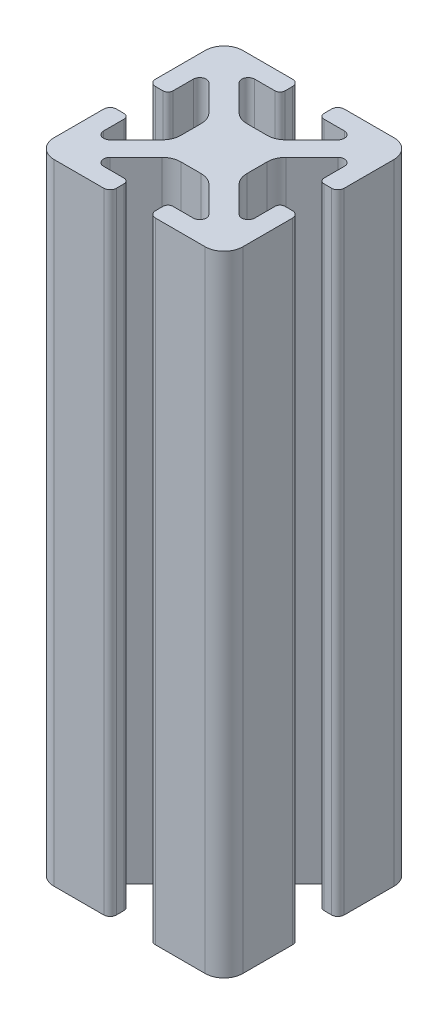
ISO-10303-21;
HEADER;
FILE_DESCRIPTION(('STEP AP214'),'2;1');
FILE_NAME('part.step','',(''),(''),'','','');
FILE_SCHEMA(('AUTOMOTIVE_DESIGN { 1 0 10303 214 1 1 1 1 }'));
ENDSEC;
DATA;
#1=APPLICATION_CONTEXT('core data for automotive mechanical design processes');
#2=APPLICATION_PROTOCOL_DEFINITION('international standard','automotive_design',2000,#1);
#3=PRODUCT_CONTEXT('',#1,'mechanical');
#4=PRODUCT('Part','Part','',(#3));
#5=PRODUCT_RELATED_PRODUCT_CATEGORY('part','',(#4));
#6=PRODUCT_DEFINITION_FORMATION('','',#4);
#7=PRODUCT_DEFINITION_CONTEXT('part definition',#1,'design');
#8=PRODUCT_DEFINITION('design','',#6,#7);
#9=PRODUCT_DEFINITION_SHAPE('','',#8);
#10=(LENGTH_UNIT() NAMED_UNIT(*) SI_UNIT(.MILLI.,.METRE.));
#11=(NAMED_UNIT(*) PLANE_ANGLE_UNIT() SI_UNIT($,.RADIAN.));
#12=(NAMED_UNIT(*) SI_UNIT($,.STERADIAN.) SOLID_ANGLE_UNIT());
#13=UNCERTAINTY_MEASURE_WITH_UNIT(LENGTH_MEASURE(1.E-05),#10,'distance_accuracy_value','');
#14=(GEOMETRIC_REPRESENTATION_CONTEXT(3) GLOBAL_UNCERTAINTY_ASSIGNED_CONTEXT((#13)) GLOBAL_UNIT_ASSIGNED_CONTEXT((#10,
#11,#12)) REPRESENTATION_CONTEXT('',''));
#15=CARTESIAN_POINT('',(0.,0.,0.));
#16=DIRECTION('',(0.,0.,1.));
#17=DIRECTION('',(1.,0.,0.));
#18=AXIS2_PLACEMENT_3D('',#15,#16,#17);
#19=CARTESIAN_POINT('',(0.,-10.,0.));
#20=DIRECTION('',(0.,-1.,0.));
#21=DIRECTION('',(0.,0.,-1.));
#22=AXIS2_PLACEMENT_3D('',#19,#20,#21);
#23=PLANE('',#22);
#24=CARTESIAN_POINT('',(0.,-10.,0.));
#25=DIRECTION('',(0.,1.,0.));
#26=DIRECTION('',(1.,0.,0.));
#27=AXIS2_PLACEMENT_3D('',#24,#25,#26);
#28=CIRCLE('',#27,2.5);
#29=CARTESIAN_POINT('',(2.5,-10.,0.));
#30=VERTEX_POINT('',#29);
#31=CARTESIAN_POINT('',(-2.5,-10.,0.));
#32=VERTEX_POINT('',#31);
#33=EDGE_CURVE('E415',#30,#32,#28,.T.);
#34=ORIENTED_EDGE('',*,*,#33,.T.);
#35=CARTESIAN_POINT('',(0.,-10.,0.));
#36=DIRECTION('',(0.,1.,0.));
#37=DIRECTION('',(1.,0.,0.));
#38=AXIS2_PLACEMENT_3D('',#35,#36,#37);
#39=CIRCLE('',#38,2.5);
#40=EDGE_CURVE('E395',#32,#30,#39,.T.);
#41=ORIENTED_EDGE('',*,*,#40,.T.);
#42=EDGE_LOOP('',(#34,#41));
#43=FACE_BOUND('',#42,.T.);
#44=CARTESIAN_POINT('',(4.1,-10.,-14.));
#45=DIRECTION('',(0.,-1.,0.));
#46=DIRECTION('',(-1.,0.,0.));
#47=AXIS2_PLACEMENT_3D('',#44,#45,#46);
#48=CIRCLE('',#47,1.);
#49=CARTESIAN_POINT('',(3.1,-10.,-14.));
#50=VERTEX_POINT('',#49);
#51=CARTESIAN_POINT('',(4.1,-10.,-15.));
#52=VERTEX_POINT('',#51);
#53=EDGE_CURVE('E322',#50,#52,#48,.T.);
#54=ORIENTED_EDGE('',*,*,#53,.T.);
#55=DIRECTION('',(-1.,0.,0.));
#56=VECTOR('',#55,1.);
#57=CARTESIAN_POINT('',(-12.,-10.,-15.));
#58=LINE('',#57,#56);
#59=CARTESIAN_POINT('',(12.,-10.,-15.));
#60=VERTEX_POINT('',#59);
#61=EDGE_CURVE('E46',#60,#52,#58,.T.);
#62=ORIENTED_EDGE('',*,*,#61,.F.);
#63=CARTESIAN_POINT('',(12.,-10.,-12.));
#64=DIRECTION('',(0.,1.,0.));
#65=DIRECTION('',(0.,0.,-1.));
#66=AXIS2_PLACEMENT_3D('',#63,#64,#65);
#67=CIRCLE('',#66,3.);
#68=CARTESIAN_POINT('',(15.,-10.,-12.));
#69=VERTEX_POINT('',#68);
#70=EDGE_CURVE('E671',#69,#60,#67,.T.);
#71=ORIENTED_EDGE('',*,*,#70,.F.);
#72=DIRECTION('',(0.,0.,-1.));
#73=VECTOR('',#72,1.);
#74=CARTESIAN_POINT('',(15.,-10.,-12.));
#75=LINE('',#74,#73);
#76=CARTESIAN_POINT('',(15.,-10.,-4.1));
#77=VERTEX_POINT('',#76);
#78=EDGE_CURVE('E456',#77,#69,#75,.T.);
#79=ORIENTED_EDGE('',*,*,#78,.F.);
#80=CARTESIAN_POINT('',(14.,-10.,-4.1));
#81=DIRECTION('',(0.,-1.,0.));
#82=DIRECTION('',(1.,0.,0.));
#83=AXIS2_PLACEMENT_3D('',#80,#81,#82);
#84=CIRCLE('',#83,1.);
#85=CARTESIAN_POINT('',(14.,-10.,-3.1));
#86=VERTEX_POINT('',#85);
#87=EDGE_CURVE('E410',#77,#86,#84,.T.);
#88=ORIENTED_EDGE('',*,*,#87,.T.);
#89=DIRECTION('',(-1.,0.,0.));
#90=VECTOR('',#89,1.);
#91=CARTESIAN_POINT('',(6.7,-10.,-3.1));
#92=LINE('',#91,#90);
#93=CARTESIAN_POINT('',(12.8,-10.,-3.1));
#94=VERTEX_POINT('',#93);
#95=EDGE_CURVE('E484',#86,#94,#92,.T.);
#96=ORIENTED_EDGE('',*,*,#95,.T.);
#97=CARTESIAN_POINT('',(12.8,-10.,-3.9));
#98=DIRECTION('',(0.,-1.,0.));
#99=DIRECTION('',(0.,0.,1.));
#100=AXIS2_PLACEMENT_3D('',#97,#98,#99);
#101=CIRCLE('',#100,0.8);
#102=CARTESIAN_POINT('',(12.,-10.,-3.9));
#103=VERTEX_POINT('',#102);
#104=EDGE_CURVE('E448',#94,#103,#101,.T.);
#105=ORIENTED_EDGE('',*,*,#104,.T.);
#106=DIRECTION('',(0.,0.,-1.));
#107=VECTOR('',#106,1.);
#108=CARTESIAN_POINT('',(12.,-10.,-2.7569097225));
#109=LINE('',#108,#107);
#110=CARTESIAN_POINT('',(12.,-10.,-7.12763889));
#111=VERTEX_POINT('',#110);
#112=EDGE_CURVE('E447',#103,#111,#109,.T.);
#113=ORIENTED_EDGE('',*,*,#112,.T.);
#114=CARTESIAN_POINT('',(10.97763889,-10.,-7.12763889));
#115=DIRECTION('',(0.,1.,0.));
#116=DIRECTION('',(-0.707106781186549,0.,-0.707106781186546));
#117=AXIS2_PLACEMENT_3D('',#114,#115,#116);
#118=CIRCLE('',#117,1.0223611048);
#119=CARTESIAN_POINT('',(10.2547204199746,-10.,-7.85055736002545));
#120=VERTEX_POINT('',#119);
#121=EDGE_CURVE('E501',#111,#120,#118,.T.);
#122=ORIENTED_EDGE('',*,*,#121,.T.);
#123=DIRECTION('',(-0.707106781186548,0.,0.707106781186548));
#124=VECTOR('',#123,1.);
#125=CARTESIAN_POINT('',(4.696890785,-10.,-2.292727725));
#126=LINE('',#125,#124);
#127=CARTESIAN_POINT('',(6.12867966,-10.,-3.7245166));
#128=VERTEX_POINT('',#127);
#129=EDGE_CURVE('E428',#120,#128,#126,.T.);
#130=ORIENTED_EDGE('',*,*,#129,.T.);
#131=CARTESIAN_POINT('',(8.25,-10.,-1.60319626));
#132=DIRECTION('',(0.,1.,0.));
#133=DIRECTION('',(-1.,0.,0.));
#134=AXIS2_PLACEMENT_3D('',#131,#132,#133);
#135=CIRCLE('',#134,3.);
#136=CARTESIAN_POINT('',(5.25,-10.,-1.60319626));
#137=VERTEX_POINT('',#136);
#138=EDGE_CURVE('E427',#128,#137,#135,.T.);
#139=ORIENTED_EDGE('',*,*,#138,.T.);
#140=DIRECTION('',(0.,0.,1.));
#141=VECTOR('',#140,1.);
#142=CARTESIAN_POINT('',(5.25,-10.,0.));
#143=LINE('',#142,#141);
#144=CARTESIAN_POINT('',(5.25,-10.,1.60319626));
#145=VERTEX_POINT('',#144);
#146=EDGE_CURVE('E334',#137,#145,#143,.T.);
#147=ORIENTED_EDGE('',*,*,#146,.T.);
#148=CARTESIAN_POINT('',(8.25,-10.,1.60319626));
#149=DIRECTION('',(0.,1.,0.));
#150=DIRECTION('',(-0.707106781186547,0.,0.707106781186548));
#151=AXIS2_PLACEMENT_3D('',#148,#149,#150);
#152=CIRCLE('',#151,2.99999999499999);
#153=CARTESIAN_POINT('',(6.12867965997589,-10.,3.72451660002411));
#154=VERTEX_POINT('',#153);
#155=EDGE_CURVE('E333',#145,#154,#152,.T.);
#156=ORIENTED_EDGE('',*,*,#155,.T.);
#157=DIRECTION('',(0.707106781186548,0.,0.707106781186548));
#158=VECTOR('',#157,1.);
#159=CARTESIAN_POINT('',(4.696890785,-10.,2.292727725));
#160=LINE('',#159,#158);
#161=CARTESIAN_POINT('',(10.25472042,-10.,7.85055736));
#162=VERTEX_POINT('',#161);
#163=EDGE_CURVE('E551',#154,#162,#160,.T.);
#164=ORIENTED_EDGE('',*,*,#163,.T.);
#165=CARTESIAN_POINT('',(10.97763889,-10.,7.12763889));
#166=DIRECTION('',(0.,1.,0.));
#167=DIRECTION('',(1.,0.,0.));
#168=AXIS2_PLACEMENT_3D('',#165,#166,#167);
#169=CIRCLE('',#168,1.02236111);
#170=CARTESIAN_POINT('',(12.,-10.,7.12763889));
#171=VERTEX_POINT('',#170);
#172=EDGE_CURVE('E594',#162,#171,#169,.T.);
#173=ORIENTED_EDGE('',*,*,#172,.T.);
#174=DIRECTION('',(0.,0.,-1.));
#175=VECTOR('',#174,1.);
#176=CARTESIAN_POINT('',(12.,-10.,2.7569097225));
#177=LINE('',#176,#175);
#178=CARTESIAN_POINT('',(12.,-10.,3.9));
#179=VERTEX_POINT('',#178);
#180=EDGE_CURVE('E593',#171,#179,#177,.T.);
#181=ORIENTED_EDGE('',*,*,#180,.T.);
#182=CARTESIAN_POINT('',(12.8,-10.,3.9));
#183=DIRECTION('',(0.,-1.,0.));
#184=DIRECTION('',(-1.,0.,0.));
#185=AXIS2_PLACEMENT_3D('',#182,#183,#184);
#186=CIRCLE('',#185,0.8);
#187=CARTESIAN_POINT('',(12.8,-10.,3.1));
#188=VERTEX_POINT('',#187);
#189=EDGE_CURVE('E429',#179,#188,#186,.T.);
#190=ORIENTED_EDGE('',*,*,#189,.T.);
#191=DIRECTION('',(1.,0.,0.));
#192=VECTOR('',#191,1.);
#193=CARTESIAN_POINT('',(6.7,-10.,3.1));
#194=LINE('',#193,#192);
#195=CARTESIAN_POINT('',(14.,-10.,3.1));
#196=VERTEX_POINT('',#195);
#197=EDGE_CURVE('E384',#188,#196,#194,.T.);
#198=ORIENTED_EDGE('',*,*,#197,.T.);
#199=CARTESIAN_POINT('',(14.,-10.,4.1));
#200=DIRECTION('',(0.,-1.,0.));
#201=DIRECTION('',(0.,0.,-1.));
#202=AXIS2_PLACEMENT_3D('',#199,#200,#201);
#203=CIRCLE('',#202,1.);
#204=CARTESIAN_POINT('',(15.,-10.,4.1));
#205=VERTEX_POINT('',#204);
#206=EDGE_CURVE('E383',#196,#205,#203,.T.);
#207=ORIENTED_EDGE('',*,*,#206,.T.);
#208=DIRECTION('',(0.,0.,-1.));
#209=VECTOR('',#208,1.);
#210=CARTESIAN_POINT('',(15.,-10.,-12.));
#211=LINE('',#210,#209);
#212=CARTESIAN_POINT('',(15.,-10.,12.));
#213=VERTEX_POINT('',#212);
#214=EDGE_CURVE('E674',#213,#205,#211,.T.);
#215=ORIENTED_EDGE('',*,*,#214,.F.);
#216=CARTESIAN_POINT('',(12.,-10.,12.));
#217=DIRECTION('',(0.,1.,0.));
#218=DIRECTION('',(1.,0.,0.));
#219=AXIS2_PLACEMENT_3D('',#216,#217,#218);
#220=CIRCLE('',#219,3.);
#221=CARTESIAN_POINT('',(12.,-10.,15.));
#222=VERTEX_POINT('',#221);
#223=EDGE_CURVE('E633',#222,#213,#220,.T.);
#224=ORIENTED_EDGE('',*,*,#223,.F.);
#225=DIRECTION('',(1.,0.,0.));
#226=VECTOR('',#225,1.);
#227=CARTESIAN_POINT('',(12.,-10.,15.));
#228=LINE('',#227,#226);
#229=CARTESIAN_POINT('',(4.1,-10.,15.));
#230=VERTEX_POINT('',#229);
#231=EDGE_CURVE('E477',#230,#222,#228,.T.);
#232=ORIENTED_EDGE('',*,*,#231,.F.);
#233=CARTESIAN_POINT('',(4.1,-10.,14.));
#234=DIRECTION('',(0.,-1.,0.));
#235=DIRECTION('',(0.,0.,1.));
#236=AXIS2_PLACEMENT_3D('',#233,#234,#235);
#237=CIRCLE('',#236,1.);
#238=CARTESIAN_POINT('',(3.1,-10.,14.));
#239=VERTEX_POINT('',#238);
#240=EDGE_CURVE('E636',#230,#239,#237,.T.);
#241=ORIENTED_EDGE('',*,*,#240,.T.);
#242=DIRECTION('',(0.,0.,-1.));
#243=VECTOR('',#242,1.);
#244=CARTESIAN_POINT('',(3.1,-10.,6.7));
#245=LINE('',#244,#243);
#246=CARTESIAN_POINT('',(3.1,-10.,12.8));
#247=VERTEX_POINT('',#246);
#248=EDGE_CURVE('E379',#239,#247,#245,.T.);
#249=ORIENTED_EDGE('',*,*,#248,.T.);
#250=CARTESIAN_POINT('',(3.9,-10.,12.8));
#251=DIRECTION('',(0.,-1.,0.));
#252=DIRECTION('',(-1.,0.,0.));
#253=AXIS2_PLACEMENT_3D('',#250,#251,#252);
#254=CIRCLE('',#253,0.8);
#255=CARTESIAN_POINT('',(3.9,-10.,12.));
#256=VERTEX_POINT('',#255);
#257=EDGE_CURVE('E576',#247,#256,#254,.T.);
#258=ORIENTED_EDGE('',*,*,#257,.T.);
#259=DIRECTION('',(1.,0.,0.));
#260=VECTOR('',#259,1.);
#261=CARTESIAN_POINT('',(2.7569097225,-10.,12.));
#262=LINE('',#261,#260);
#263=CARTESIAN_POINT('',(7.12763889,-10.,12.));
#264=VERTEX_POINT('',#263);
#265=EDGE_CURVE('E476',#256,#264,#262,.T.);
#266=ORIENTED_EDGE('',*,*,#265,.T.);
#267=CARTESIAN_POINT('',(7.12763889,-10.,10.97763889));
#268=DIRECTION('',(0.,1.,0.));
#269=DIRECTION('',(0.707106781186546,0.,-0.707106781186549));
#270=AXIS2_PLACEMENT_3D('',#267,#268,#269);
#271=CIRCLE('',#270,1.0223611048);
#272=CARTESIAN_POINT('',(7.85055736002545,-10.,10.2547204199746));
#273=VERTEX_POINT('',#272);
#274=EDGE_CURVE('E475',#264,#273,#271,.T.);
#275=ORIENTED_EDGE('',*,*,#274,.T.);
#276=DIRECTION('',(-0.707106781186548,0.,-0.707106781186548));
#277=VECTOR('',#276,1.);
#278=CARTESIAN_POINT('',(2.292727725,-10.,4.696890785));
#279=LINE('',#278,#277);
#280=CARTESIAN_POINT('',(3.7245166,-10.,6.12867966));
#281=VERTEX_POINT('',#280);
#282=EDGE_CURVE('E616',#273,#281,#279,.T.);
#283=ORIENTED_EDGE('',*,*,#282,.T.);
#284=CARTESIAN_POINT('',(1.60319626,-10.,8.25));
#285=DIRECTION('',(0.,1.,0.));
#286=DIRECTION('',(0.,0.,-1.));
#287=AXIS2_PLACEMENT_3D('',#284,#285,#286);
#288=CIRCLE('',#287,3.);
#289=CARTESIAN_POINT('',(1.60319626,-10.,5.25));
#290=VERTEX_POINT('',#289);
#291=EDGE_CURVE('E419',#281,#290,#288,.T.);
#292=ORIENTED_EDGE('',*,*,#291,.T.);
#293=DIRECTION('',(-1.,0.,0.));
#294=VECTOR('',#293,1.);
#295=CARTESIAN_POINT('',(0.,-10.,5.25));
#296=LINE('',#295,#294);
#297=CARTESIAN_POINT('',(-1.60319626,-10.,5.25));
#298=VERTEX_POINT('',#297);
#299=EDGE_CURVE('E469',#290,#298,#296,.T.);
#300=ORIENTED_EDGE('',*,*,#299,.T.);
#301=CARTESIAN_POINT('',(-1.60319626,-10.,8.25));
#302=DIRECTION('',(0.,1.,0.));
#303=DIRECTION('',(-0.707106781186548,0.,-0.707106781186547));
#304=AXIS2_PLACEMENT_3D('',#301,#302,#303);
#305=CIRCLE('',#304,2.99999999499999);
#306=CARTESIAN_POINT('',(-3.72451660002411,-10.,6.12867965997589));
#307=VERTEX_POINT('',#306);
#308=EDGE_CURVE('E404',#298,#307,#305,.T.);
#309=ORIENTED_EDGE('',*,*,#308,.T.);
#310=DIRECTION('',(-0.707106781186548,0.,0.707106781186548));
#311=VECTOR('',#310,1.);
#312=CARTESIAN_POINT('',(-2.292727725,-10.,4.696890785));
#313=LINE('',#312,#311);
#314=CARTESIAN_POINT('',(-7.85055736,-10.,10.25472042));
#315=VERTEX_POINT('',#314);
#316=EDGE_CURVE('E403',#307,#315,#313,.T.);
#317=ORIENTED_EDGE('',*,*,#316,.T.);
#318=CARTESIAN_POINT('',(-7.12763889,-10.,10.97763889));
#319=DIRECTION('',(0.,1.,0.));
#320=DIRECTION('',(0.,0.,1.));
#321=AXIS2_PLACEMENT_3D('',#318,#319,#320);
#322=CIRCLE('',#321,1.02236111);
#323=CARTESIAN_POINT('',(-7.12763889,-10.,12.));
#324=VERTEX_POINT('',#323);
#325=EDGE_CURVE('E437',#315,#324,#322,.T.);
#326=ORIENTED_EDGE('',*,*,#325,.T.);
#327=DIRECTION('',(1.,0.,0.));
#328=VECTOR('',#327,1.);
#329=CARTESIAN_POINT('',(-2.7569097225,-10.,12.));
#330=LINE('',#329,#328);
#331=CARTESIAN_POINT('',(-3.9,-10.,12.));
#332=VERTEX_POINT('',#331);
#333=EDGE_CURVE('E390',#324,#332,#330,.T.);
#334=ORIENTED_EDGE('',*,*,#333,.T.);
#335=CARTESIAN_POINT('',(-3.9,-10.,12.8));
#336=DIRECTION('',(0.,-1.,0.));
#337=DIRECTION('',(0.,0.,-1.));
#338=AXIS2_PLACEMENT_3D('',#335,#336,#337);
#339=CIRCLE('',#338,0.8);
#340=CARTESIAN_POINT('',(-3.1,-10.,12.8));
#341=VERTEX_POINT('',#340);
#342=EDGE_CURVE('E350',#332,#341,#339,.T.);
#343=ORIENTED_EDGE('',*,*,#342,.T.);
#344=DIRECTION('',(0.,0.,1.));
#345=VECTOR('',#344,1.);
#346=CARTESIAN_POINT('',(-3.1,-10.,6.7));
#347=LINE('',#346,#345);
#348=CARTESIAN_POINT('',(-3.1,-10.,14.));
#349=VERTEX_POINT('',#348);
#350=EDGE_CURVE('E359',#341,#349,#347,.T.);
#351=ORIENTED_EDGE('',*,*,#350,.T.);
#352=CARTESIAN_POINT('',(-4.1,-10.,14.));
#353=DIRECTION('',(0.,-1.,0.));
#354=DIRECTION('',(1.,0.,0.));
#355=AXIS2_PLACEMENT_3D('',#352,#353,#354);
#356=CIRCLE('',#355,1.);
#357=CARTESIAN_POINT('',(-4.1,-10.,15.));
#358=VERTEX_POINT('',#357);
#359=EDGE_CURVE('E391',#349,#358,#356,.T.);
#360=ORIENTED_EDGE('',*,*,#359,.T.);
#361=DIRECTION('',(1.,0.,0.));
#362=VECTOR('',#361,1.);
#363=CARTESIAN_POINT('',(12.,-10.,15.));
#364=LINE('',#363,#362);
#365=CARTESIAN_POINT('',(-12.,-10.,15.));
#366=VERTEX_POINT('',#365);
#367=EDGE_CURVE('E547',#366,#358,#364,.T.);
#368=ORIENTED_EDGE('',*,*,#367,.F.);
#369=CARTESIAN_POINT('',(-12.,-10.,12.));
#370=DIRECTION('',(0.,1.,0.));
#371=DIRECTION('',(0.,0.,1.));
#372=AXIS2_PLACEMENT_3D('',#369,#370,#371);
#373=CIRCLE('',#372,3.);
#374=CARTESIAN_POINT('',(-15.,-10.,12.));
#375=VERTEX_POINT('',#374);
#376=EDGE_CURVE('E512',#375,#366,#373,.T.);
#377=ORIENTED_EDGE('',*,*,#376,.F.);
#378=DIRECTION('',(0.,0.,1.));
#379=VECTOR('',#378,1.);
#380=CARTESIAN_POINT('',(-15.,-10.,12.));
#381=LINE('',#380,#379);
#382=CARTESIAN_POINT('',(-15.,-10.,4.1));
#383=VERTEX_POINT('',#382);
#384=EDGE_CURVE('E291',#383,#375,#381,.T.);
#385=ORIENTED_EDGE('',*,*,#384,.F.);
#386=CARTESIAN_POINT('',(-14.,-10.,4.1));
#387=DIRECTION('',(0.,-1.,0.));
#388=DIRECTION('',(-1.,0.,0.));
#389=AXIS2_PLACEMENT_3D('',#386,#387,#388);
#390=CIRCLE('',#389,1.);
#391=CARTESIAN_POINT('',(-14.,-10.,3.1));
#392=VERTEX_POINT('',#391);
#393=EDGE_CURVE('E285',#383,#392,#390,.T.);
#394=ORIENTED_EDGE('',*,*,#393,.T.);
#395=DIRECTION('',(1.,0.,0.));
#396=VECTOR('',#395,1.);
#397=CARTESIAN_POINT('',(-6.7,-10.,3.1));
#398=LINE('',#397,#396);
#399=CARTESIAN_POINT('',(-12.8,-10.,3.1));
#400=VERTEX_POINT('',#399);
#401=EDGE_CURVE('E289',#392,#400,#398,.T.);
#402=ORIENTED_EDGE('',*,*,#401,.T.);
#403=CARTESIAN_POINT('',(-12.8,-10.,3.9));
#404=DIRECTION('',(0.,-1.,0.));
#405=DIRECTION('',(0.,0.,-1.));
#406=AXIS2_PLACEMENT_3D('',#403,#404,#405);
#407=CIRCLE('',#406,0.8);
#408=CARTESIAN_POINT('',(-12.,-10.,3.9));
#409=VERTEX_POINT('',#408);
#410=EDGE_CURVE('E356',#400,#409,#407,.T.);
#411=ORIENTED_EDGE('',*,*,#410,.T.);
#412=DIRECTION('',(0.,0.,1.));
#413=VECTOR('',#412,1.);
#414=CARTESIAN_POINT('',(-12.,-10.,2.7569097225));
#415=LINE('',#414,#413);
#416=CARTESIAN_POINT('',(-12.,-10.,7.12763889));
#417=VERTEX_POINT('',#416);
#418=EDGE_CURVE('E461',#409,#417,#415,.T.);
#419=ORIENTED_EDGE('',*,*,#418,.T.);
#420=CARTESIAN_POINT('',(-10.97763889,-10.,7.12763889));
#421=DIRECTION('',(0.,1.,0.));
#422=DIRECTION('',(0.707106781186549,0.,0.707106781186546));
#423=AXIS2_PLACEMENT_3D('',#420,#421,#422);
#424=CIRCLE('',#423,1.0223611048);
#425=CARTESIAN_POINT('',(-10.2547204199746,-10.,7.85055736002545));
#426=VERTEX_POINT('',#425);
#427=EDGE_CURVE('E349',#417,#426,#424,.T.);
#428=ORIENTED_EDGE('',*,*,#427,.T.);
#429=DIRECTION('',(0.707106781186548,0.,-0.707106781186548));
#430=VECTOR('',#429,1.);
#431=CARTESIAN_POINT('',(-4.696890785,-10.,2.292727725));
#432=LINE('',#431,#430);
#433=CARTESIAN_POINT('',(-6.12867966,-10.,3.7245166));
#434=VERTEX_POINT('',#433);
#435=EDGE_CURVE('E348',#426,#434,#432,.T.);
#436=ORIENTED_EDGE('',*,*,#435,.T.);
#437=CARTESIAN_POINT('',(-8.25,-10.,1.60319626));
#438=DIRECTION('',(0.,1.,0.));
#439=DIRECTION('',(1.,0.,0.));
#440=AXIS2_PLACEMENT_3D('',#437,#438,#439);
#441=CIRCLE('',#440,3.);
#442=CARTESIAN_POINT('',(-5.25,-10.,1.60319626));
#443=VERTEX_POINT('',#442);
#444=EDGE_CURVE('E335',#434,#443,#441,.T.);
#445=ORIENTED_EDGE('',*,*,#444,.T.);
#446=DIRECTION('',(0.,0.,-1.));
#447=VECTOR('',#446,1.);
#448=CARTESIAN_POINT('',(-5.25,-10.,0.));
#449=LINE('',#448,#447);
#450=CARTESIAN_POINT('',(-5.25,-10.,-1.60319626));
#451=VERTEX_POINT('',#450);
#452=EDGE_CURVE('E580',#443,#451,#449,.T.);
#453=ORIENTED_EDGE('',*,*,#452,.T.);
#454=CARTESIAN_POINT('',(-8.25,-10.,-1.60319626));
#455=DIRECTION('',(0.,1.,0.));
#456=DIRECTION('',(0.707106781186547,0.,-0.707106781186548));
#457=AXIS2_PLACEMENT_3D('',#454,#455,#456);
#458=CIRCLE('',#457,2.99999999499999);
#459=CARTESIAN_POINT('',(-6.12867965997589,-10.,-3.72451660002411));
#460=VERTEX_POINT('',#459);
#461=EDGE_CURVE('E566',#451,#460,#458,.T.);
#462=ORIENTED_EDGE('',*,*,#461,.T.);
#463=DIRECTION('',(-0.707106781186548,0.,-0.707106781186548));
#464=VECTOR('',#463,1.);
#465=CARTESIAN_POINT('',(-4.696890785,-10.,-2.292727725));
#466=LINE('',#465,#464);
#467=CARTESIAN_POINT('',(-10.25472042,-10.,-7.85055736));
#468=VERTEX_POINT('',#467);
#469=EDGE_CURVE('E575',#460,#468,#466,.T.);
#470=ORIENTED_EDGE('',*,*,#469,.T.);
#471=CARTESIAN_POINT('',(-10.97763889,-10.,-7.12763889));
#472=DIRECTION('',(0.,1.,0.));
#473=DIRECTION('',(-1.,0.,0.));
#474=AXIS2_PLACEMENT_3D('',#471,#472,#473);
#475=CIRCLE('',#474,1.02236111);
#476=CARTESIAN_POINT('',(-12.,-10.,-7.12763889));
#477=VERTEX_POINT('',#476);
#478=EDGE_CURVE('E340',#468,#477,#475,.T.);
#479=ORIENTED_EDGE('',*,*,#478,.T.);
#480=DIRECTION('',(0.,0.,1.));
#481=VECTOR('',#480,1.);
#482=CARTESIAN_POINT('',(-12.,-10.,-2.7569097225));
#483=LINE('',#482,#481);
#484=CARTESIAN_POINT('',(-12.,-10.,-3.9));
#485=VERTEX_POINT('',#484);
#486=EDGE_CURVE('E536',#477,#485,#483,.T.);
#487=ORIENTED_EDGE('',*,*,#486,.T.);
#488=CARTESIAN_POINT('',(-12.8,-10.,-3.9));
#489=DIRECTION('',(0.,-1.,0.));
#490=DIRECTION('',(1.,0.,0.));
#491=AXIS2_PLACEMENT_3D('',#488,#489,#490);
#492=CIRCLE('',#491,0.8);
#493=CARTESIAN_POINT('',(-12.8,-10.,-3.1));
#494=VERTEX_POINT('',#493);
#495=EDGE_CURVE('E253',#485,#494,#492,.T.);
#496=ORIENTED_EDGE('',*,*,#495,.T.);
#497=DIRECTION('',(-1.,0.,0.));
#498=VECTOR('',#497,1.);
#499=CARTESIAN_POINT('',(-6.7,-10.,-3.1));
#500=LINE('',#499,#498);
#501=CARTESIAN_POINT('',(-14.,-10.,-3.1));
#502=VERTEX_POINT('',#501);
#503=EDGE_CURVE('E246',#494,#502,#500,.T.);
#504=ORIENTED_EDGE('',*,*,#503,.T.);
#505=CARTESIAN_POINT('',(-14.,-10.,-4.1));
#506=DIRECTION('',(0.,-1.,0.));
#507=DIRECTION('',(0.,0.,1.));
#508=AXIS2_PLACEMENT_3D('',#505,#506,#507);
#509=CIRCLE('',#508,1.);
#510=CARTESIAN_POINT('',(-15.,-10.,-4.1));
#511=VERTEX_POINT('',#510);
#512=EDGE_CURVE('E471',#502,#511,#509,.T.);
#513=ORIENTED_EDGE('',*,*,#512,.T.);
#514=DIRECTION('',(0.,0.,1.));
#515=VECTOR('',#514,1.);
#516=CARTESIAN_POINT('',(-15.,-10.,12.));
#517=LINE('',#516,#515);
#518=CARTESIAN_POINT('',(-15.,-10.,-12.));
#519=VERTEX_POINT('',#518);
#520=EDGE_CURVE('E516',#519,#511,#517,.T.);
#521=ORIENTED_EDGE('',*,*,#520,.F.);
#522=CARTESIAN_POINT('',(-12.,-10.,-12.));
#523=DIRECTION('',(0.,1.,0.));
#524=DIRECTION('',(-1.,0.,0.));
#525=AXIS2_PLACEMENT_3D('',#522,#523,#524);
#526=CIRCLE('',#525,3.);
#527=CARTESIAN_POINT('',(-12.,-10.,-15.));
#528=VERTEX_POINT('',#527);
#529=EDGE_CURVE('E11',#528,#519,#526,.T.);
#530=ORIENTED_EDGE('',*,*,#529,.F.);
#531=DIRECTION('',(-1.,0.,0.));
#532=VECTOR('',#531,1.);
#533=CARTESIAN_POINT('',(-12.,-10.,-15.));
#534=LINE('',#533,#532);
#535=CARTESIAN_POINT('',(-4.1,-10.,-15.));
#536=VERTEX_POINT('',#535);
#537=EDGE_CURVE('E316',#536,#528,#534,.T.);
#538=ORIENTED_EDGE('',*,*,#537,.F.);
#539=CARTESIAN_POINT('',(-4.1,-10.,-14.));
#540=DIRECTION('',(0.,-1.,0.));
#541=DIRECTION('',(0.,0.,-1.));
#542=AXIS2_PLACEMENT_3D('',#539,#540,#541);
#543=CIRCLE('',#542,1.);
#544=CARTESIAN_POINT('',(-3.1,-10.,-14.));
#545=VERTEX_POINT('',#544);
#546=EDGE_CURVE('E329',#536,#545,#543,.T.);
#547=ORIENTED_EDGE('',*,*,#546,.T.);
#548=DIRECTION('',(0.,0.,1.));
#549=VECTOR('',#548,1.);
#550=CARTESIAN_POINT('',(-3.1,-10.,-6.7));
#551=LINE('',#550,#549);
#552=CARTESIAN_POINT('',(-3.1,-10.,-12.8));
#553=VERTEX_POINT('',#552);
#554=EDGE_CURVE('E416',#545,#553,#551,.T.);
#555=ORIENTED_EDGE('',*,*,#554,.T.);
#556=CARTESIAN_POINT('',(-3.9,-10.,-12.8));
#557=DIRECTION('',(0.,-1.,0.));
#558=DIRECTION('',(1.,0.,0.));
#559=AXIS2_PLACEMENT_3D('',#556,#557,#558);
#560=CIRCLE('',#559,0.8);
#561=CARTESIAN_POINT('',(-3.9,-10.,-12.));
#562=VERTEX_POINT('',#561);
#563=EDGE_CURVE('E492',#553,#562,#560,.T.);
#564=ORIENTED_EDGE('',*,*,#563,.T.);
#565=DIRECTION('',(-1.,0.,0.));
#566=VECTOR('',#565,1.);
#567=CARTESIAN_POINT('',(-2.7569097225,-10.,-12.));
#568=LINE('',#567,#566);
#569=CARTESIAN_POINT('',(-7.12763889,-10.,-12.));
#570=VERTEX_POINT('',#569);
#571=EDGE_CURVE('E370',#562,#570,#568,.T.);
#572=ORIENTED_EDGE('',*,*,#571,.T.);
#573=CARTESIAN_POINT('',(-7.12763889,-10.,-10.97763889));
#574=DIRECTION('',(0.,1.,0.));
#575=DIRECTION('',(-0.707106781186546,0.,0.707106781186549));
#576=AXIS2_PLACEMENT_3D('',#573,#574,#575);
#577=CIRCLE('',#576,1.0223611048);
#578=CARTESIAN_POINT('',(-7.85055736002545,-10.,-10.2547204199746));
#579=VERTEX_POINT('',#578);
#580=EDGE_CURVE('E611',#570,#579,#577,.T.);
#581=ORIENTED_EDGE('',*,*,#580,.T.);
#582=DIRECTION('',(0.707106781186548,0.,0.707106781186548));
#583=VECTOR('',#582,1.);
#584=CARTESIAN_POINT('',(-2.292727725,-10.,-4.696890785));
#585=LINE('',#584,#583);
#586=CARTESIAN_POINT('',(-3.7245166,-10.,-6.12867966));
#587=VERTEX_POINT('',#586);
#588=EDGE_CURVE('E411',#579,#587,#585,.T.);
#589=ORIENTED_EDGE('',*,*,#588,.T.);
#590=CARTESIAN_POINT('',(-1.60319626,-10.,-8.25));
#591=DIRECTION('',(0.,1.,0.));
#592=DIRECTION('',(0.,0.,1.));
#593=AXIS2_PLACEMENT_3D('',#590,#591,#592);
#594=CIRCLE('',#593,3.);
#595=CARTESIAN_POINT('',(-1.60319626,-10.,-5.25));
#596=VERTEX_POINT('',#595);
#597=EDGE_CURVE('E508',#587,#596,#594,.T.);
#598=ORIENTED_EDGE('',*,*,#597,.T.);
#599=DIRECTION('',(1.,0.,0.));
#600=VECTOR('',#599,1.);
#601=CARTESIAN_POINT('',(0.,-10.,-5.25));
#602=LINE('',#601,#600);
#603=CARTESIAN_POINT('',(1.60319626,-10.,-5.25));
#604=VERTEX_POINT('',#603);
#605=EDGE_CURVE('E507',#596,#604,#602,.T.);
#606=ORIENTED_EDGE('',*,*,#605,.T.);
#607=CARTESIAN_POINT('',(1.60319626,-10.,-8.25));
#608=DIRECTION('',(0.,1.,0.));
#609=DIRECTION('',(0.707106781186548,0.,0.707106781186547));
#610=AXIS2_PLACEMENT_3D('',#607,#608,#609);
#611=CIRCLE('',#610,2.99999999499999);
#612=CARTESIAN_POINT('',(3.72451660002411,-10.,-6.12867965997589));
#613=VERTEX_POINT('',#612);
#614=EDGE_CURVE('E533',#604,#613,#611,.T.);
#615=ORIENTED_EDGE('',*,*,#614,.T.);
#616=DIRECTION('',(0.707106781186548,0.,-0.707106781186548));
#617=VECTOR('',#616,1.);
#618=CARTESIAN_POINT('',(2.292727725,-10.,-4.696890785));
#619=LINE('',#618,#617);
#620=CARTESIAN_POINT('',(7.85055736,-10.,-10.25472042));
#621=VERTEX_POINT('',#620);
#622=EDGE_CURVE('E493',#613,#621,#619,.T.);
#623=ORIENTED_EDGE('',*,*,#622,.T.);
#624=CARTESIAN_POINT('',(7.12763889,-10.,-10.97763889));
#625=DIRECTION('',(0.,1.,0.));
#626=DIRECTION('',(0.,0.,-1.));
#627=AXIS2_PLACEMENT_3D('',#624,#625,#626);
#628=CIRCLE('',#627,1.02236111);
#629=CARTESIAN_POINT('',(7.12763889,-10.,-12.));
#630=VERTEX_POINT('',#629);
#631=EDGE_CURVE('E366',#621,#630,#628,.T.);
#632=ORIENTED_EDGE('',*,*,#631,.T.);
#633=DIRECTION('',(-1.,0.,0.));
#634=VECTOR('',#633,1.);
#635=CARTESIAN_POINT('',(2.7569097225,-10.,-12.));
#636=LINE('',#635,#634);
#637=CARTESIAN_POINT('',(3.9,-10.,-12.));
#638=VERTEX_POINT('',#637);
#639=EDGE_CURVE('E365',#630,#638,#636,.T.);
#640=ORIENTED_EDGE('',*,*,#639,.T.);
#641=CARTESIAN_POINT('',(3.9,-10.,-12.8));
#642=DIRECTION('',(0.,-1.,0.));
#643=DIRECTION('',(0.,0.,1.));
#644=AXIS2_PLACEMENT_3D('',#641,#642,#643);
#645=CIRCLE('',#644,0.8);
#646=CARTESIAN_POINT('',(3.1,-10.,-12.8));
#647=VERTEX_POINT('',#646);
#648=EDGE_CURVE('E604',#638,#647,#645,.T.);
#649=ORIENTED_EDGE('',*,*,#648,.T.);
#650=DIRECTION('',(0.,0.,-1.));
#651=VECTOR('',#650,1.);
#652=CARTESIAN_POINT('',(3.1,-10.,-6.7));
#653=LINE('',#652,#651);
#654=EDGE_CURVE('E511',#647,#50,#653,.T.);
#655=ORIENTED_EDGE('',*,*,#654,.T.);
#656=EDGE_LOOP('',(#54,#62,#71,#79,#88,#96,#105,#113,#122,#130,#139,#147,#156,#164,#173,#181,
#190,#198,#207,#215,#224,#232,#241,#249,#258,#266,#275,#283,#292,#300,#309,#317,#326,#334,#343,
#351,#360,#368,#377,#385,#394,#402,#411,#419,#428,#436,#445,#453,#462,#470,#479,#487,#496,#504,
#513,#521,#530,#538,#547,#555,#564,#572,#581,#589,#598,#606,#615,#623,#632,#640,#649,#655));
#657=FACE_BOUND('',#656,.T.);
#658=ADVANCED_FACE('F36',(#43,#657),#23,.T.);
#659=CARTESIAN_POINT('',(-12.,10.,-12.));
#660=DIRECTION('',(0.,-1.,0.));
#661=DIRECTION('',(-1.,0.,0.));
#662=AXIS2_PLACEMENT_3D('',#659,#660,#661);
#663=CYLINDRICAL_SURFACE('',#662,3.);
#664=ORIENTED_EDGE('',*,*,#529,.T.);
#665=DIRECTION('',(0.,-1.,0.));
#666=VECTOR('',#665,1.);
#667=CARTESIAN_POINT('',(-15.,10.,-12.));
#668=LINE('',#667,#666);
#669=CARTESIAN_POINT('',(-15.,90.,-12.));
#670=VERTEX_POINT('',#669);
#671=EDGE_CURVE('E544',#670,#519,#668,.T.);
#672=ORIENTED_EDGE('',*,*,#671,.F.);
#673=CARTESIAN_POINT('',(-12.,90.,-12.));
#674=DIRECTION('',(0.,1.,0.));
#675=DIRECTION('',(0.,0.,1.));
#676=AXIS2_PLACEMENT_3D('',#673,#674,#675);
#677=CIRCLE('',#676,3.);
#678=CARTESIAN_POINT('',(-12.,90.,-15.));
#679=VERTEX_POINT('',#678);
#680=EDGE_CURVE('E1396',#679,#670,#677,.T.);
#681=ORIENTED_EDGE('',*,*,#680,.F.);
#682=DIRECTION('',(0.,-1.,0.));
#683=VECTOR('',#682,1.);
#684=CARTESIAN_POINT('',(-12.,10.,-15.));
#685=LINE('',#684,#683);
#686=EDGE_CURVE('E313',#679,#528,#685,.T.);
#687=ORIENTED_EDGE('',*,*,#686,.T.);
#688=EDGE_LOOP('',(#664,#672,#681,#687));
#689=FACE_BOUND('',#688,.T.);
#690=ADVANCED_FACE('F989',(#689),#663,.T.);
#691=CARTESIAN_POINT('',(0.,10.,-15.));
#692=DIRECTION('',(0.,0.,-1.));
#693=DIRECTION('',(0.,-1.,0.));
#694=AXIS2_PLACEMENT_3D('',#691,#692,#693);
#695=PLANE('',#694);
#696=DIRECTION('',(0.,1.,0.));
#697=VECTOR('',#696,1.);
#698=CARTESIAN_POINT('',(4.1,0.,-15.));
#699=LINE('',#698,#697);
#700=CARTESIAN_POINT('',(4.1,90.,-15.));
#701=VERTEX_POINT('',#700);
#702=EDGE_CURVE('E324',#52,#701,#699,.T.);
#703=ORIENTED_EDGE('',*,*,#702,.T.);
#704=DIRECTION('',(-1.,0.,0.));
#705=VECTOR('',#704,1.);
#706=CARTESIAN_POINT('',(12.,90.,-15.));
#707=LINE('',#706,#705);
#708=CARTESIAN_POINT('',(12.,90.,-15.));
#709=VERTEX_POINT('',#708);
#710=EDGE_CURVE('E451',#709,#701,#707,.T.);
#711=ORIENTED_EDGE('',*,*,#710,.F.);
#712=DIRECTION('',(0.,-1.,0.));
#713=VECTOR('',#712,1.);
#714=CARTESIAN_POINT('',(12.,10.,-15.));
#715=LINE('',#714,#713);
#716=EDGE_CURVE('E565',#709,#60,#715,.T.);
#717=ORIENTED_EDGE('',*,*,#716,.T.);
#718=ORIENTED_EDGE('',*,*,#61,.T.);
#719=EDGE_LOOP('',(#703,#711,#717,#718));
#720=FACE_BOUND('',#719,.T.);
#721=ADVANCED_FACE('F995',(#720),#695,.T.);
#722=CARTESIAN_POINT('',(12.,10.,-12.));
#723=DIRECTION('',(0.,-1.,0.));
#724=DIRECTION('',(0.,0.,-1.));
#725=AXIS2_PLACEMENT_3D('',#722,#723,#724);
#726=CYLINDRICAL_SURFACE('',#725,3.);
#727=ORIENTED_EDGE('',*,*,#70,.T.);
#728=ORIENTED_EDGE('',*,*,#716,.F.);
#729=CARTESIAN_POINT('',(12.,90.,-12.));
#730=DIRECTION('',(0.,1.,0.));
#731=DIRECTION('',(0.,0.,1.));
#732=AXIS2_PLACEMENT_3D('',#729,#730,#731);
#733=CIRCLE('',#732,3.);
#734=CARTESIAN_POINT('',(15.,90.,-12.));
#735=VERTEX_POINT('',#734);
#736=EDGE_CURVE('E785',#735,#709,#733,.T.);
#737=ORIENTED_EDGE('',*,*,#736,.F.);
#738=DIRECTION('',(0.,-1.,0.));
#739=VECTOR('',#738,1.);
#740=CARTESIAN_POINT('',(15.,10.,-12.));
#741=LINE('',#740,#739);
#742=EDGE_CURVE('E459',#735,#69,#741,.T.);
#743=ORIENTED_EDGE('',*,*,#742,.T.);
#744=EDGE_LOOP('',(#727,#728,#737,#743));
#745=FACE_BOUND('',#744,.T.);
#746=ADVANCED_FACE('F1019',(#745),#726,.T.);
#747=CARTESIAN_POINT('',(15.,10.,0.));
#748=DIRECTION('',(1.,0.,0.));
#749=DIRECTION('',(0.,1.,0.));
#750=AXIS2_PLACEMENT_3D('',#747,#748,#749);
#751=PLANE('',#750);
#752=DIRECTION('',(0.,1.,0.));
#753=VECTOR('',#752,1.);
#754=CARTESIAN_POINT('',(15.,0.,4.1));
#755=LINE('',#754,#753);
#756=CARTESIAN_POINT('',(15.,90.,4.1));
#757=VERTEX_POINT('',#756);
#758=EDGE_CURVE('E407',#205,#757,#755,.T.);
#759=ORIENTED_EDGE('',*,*,#758,.T.);
#760=DIRECTION('',(0.,0.,-1.));
#761=VECTOR('',#760,1.);
#762=CARTESIAN_POINT('',(15.,90.,12.));
#763=LINE('',#762,#761);
#764=CARTESIAN_POINT('',(15.,90.,12.));
#765=VERTEX_POINT('',#764);
#766=EDGE_CURVE('E912',#765,#757,#763,.T.);
#767=ORIENTED_EDGE('',*,*,#766,.F.);
#768=DIRECTION('',(0.,-1.,0.));
#769=VECTOR('',#768,1.);
#770=CARTESIAN_POINT('',(15.,10.,12.));
#771=LINE('',#770,#769);
#772=EDGE_CURVE('E40',#765,#213,#771,.T.);
#773=ORIENTED_EDGE('',*,*,#772,.T.);
#774=ORIENTED_EDGE('',*,*,#214,.T.);
#775=EDGE_LOOP('',(#759,#767,#773,#774));
#776=FACE_BOUND('',#775,.T.);
#777=ADVANCED_FACE('F1071',(#776),#751,.T.);
#778=CARTESIAN_POINT('',(12.,10.,12.));
#779=DIRECTION('',(0.,-1.,0.));
#780=DIRECTION('',(1.,0.,0.));
#781=AXIS2_PLACEMENT_3D('',#778,#779,#780);
#782=CYLINDRICAL_SURFACE('',#781,3.);
#783=ORIENTED_EDGE('',*,*,#223,.T.);
#784=ORIENTED_EDGE('',*,*,#772,.F.);
#785=CARTESIAN_POINT('',(12.,90.,12.));
#786=DIRECTION('',(0.,1.,0.));
#787=DIRECTION('',(0.,0.,1.));
#788=AXIS2_PLACEMENT_3D('',#785,#786,#787);
#789=CIRCLE('',#788,3.);
#790=CARTESIAN_POINT('',(12.,90.,15.));
#791=VERTEX_POINT('',#790);
#792=EDGE_CURVE('E909',#791,#765,#789,.T.);
#793=ORIENTED_EDGE('',*,*,#792,.F.);
#794=DIRECTION('',(0.,-1.,0.));
#795=VECTOR('',#794,1.);
#796=CARTESIAN_POINT('',(12.,10.,15.));
#797=LINE('',#796,#795);
#798=EDGE_CURVE('E480',#791,#222,#797,.T.);
#799=ORIENTED_EDGE('',*,*,#798,.T.);
#800=EDGE_LOOP('',(#783,#784,#793,#799));
#801=FACE_BOUND('',#800,.T.);
#802=ADVANCED_FACE('F1151',(#801),#782,.T.);
#803=CARTESIAN_POINT('',(0.,10.,15.));
#804=DIRECTION('',(0.,0.,1.));
#805=DIRECTION('',(1.,0.,0.));
#806=AXIS2_PLACEMENT_3D('',#803,#804,#805);
#807=PLANE('',#806);
#808=DIRECTION('',(0.,1.,0.));
#809=VECTOR('',#808,1.);
#810=CARTESIAN_POINT('',(-4.1,0.,15.));
#811=LINE('',#810,#809);
#812=CARTESIAN_POINT('',(-4.1,90.,15.));
#813=VERTEX_POINT('',#812);
#814=EDGE_CURVE('E394',#358,#813,#811,.T.);
#815=ORIENTED_EDGE('',*,*,#814,.T.);
#816=DIRECTION('',(1.,0.,0.));
#817=VECTOR('',#816,1.);
#818=CARTESIAN_POINT('',(-12.,90.,15.));
#819=LINE('',#818,#817);
#820=CARTESIAN_POINT('',(-12.,90.,15.));
#821=VERTEX_POINT('',#820);
#822=EDGE_CURVE('E858',#821,#813,#819,.T.);
#823=ORIENTED_EDGE('',*,*,#822,.F.);
#824=DIRECTION('',(0.,-1.,0.));
#825=VECTOR('',#824,1.);
#826=CARTESIAN_POINT('',(-12.,10.,15.));
#827=LINE('',#826,#825);
#828=EDGE_CURVE('E515',#821,#366,#827,.T.);
#829=ORIENTED_EDGE('',*,*,#828,.T.);
#830=ORIENTED_EDGE('',*,*,#367,.T.);
#831=EDGE_LOOP('',(#815,#823,#829,#830));
#832=FACE_BOUND('',#831,.T.);
#833=ADVANCED_FACE('F1149',(#832),#807,.T.);
#834=CARTESIAN_POINT('',(-12.,10.,12.));
#835=DIRECTION('',(0.,-1.,0.));
#836=DIRECTION('',(0.,0.,1.));
#837=AXIS2_PLACEMENT_3D('',#834,#835,#836);
#838=CYLINDRICAL_SURFACE('',#837,3.);
#839=ORIENTED_EDGE('',*,*,#376,.T.);
#840=ORIENTED_EDGE('',*,*,#828,.F.);
#841=CARTESIAN_POINT('',(-12.,90.,12.));
#842=DIRECTION('',(0.,1.,0.));
#843=DIRECTION('',(0.,0.,1.));
#844=AXIS2_PLACEMENT_3D('',#841,#842,#843);
#845=CIRCLE('',#844,3.);
#846=CARTESIAN_POINT('',(-15.,90.,12.));
#847=VERTEX_POINT('',#846);
#848=EDGE_CURVE('E855',#847,#821,#845,.T.);
#849=ORIENTED_EDGE('',*,*,#848,.F.);
#850=DIRECTION('',(0.,-1.,0.));
#851=VECTOR('',#850,1.);
#852=CARTESIAN_POINT('',(-15.,10.,12.));
#853=LINE('',#852,#851);
#854=EDGE_CURVE('E406',#847,#375,#853,.T.);
#855=ORIENTED_EDGE('',*,*,#854,.T.);
#856=EDGE_LOOP('',(#839,#840,#849,#855));
#857=FACE_BOUND('',#856,.T.);
#858=ADVANCED_FACE('F1044',(#857),#838,.T.);
#859=CARTESIAN_POINT('',(-15.,10.,0.));
#860=DIRECTION('',(-1.,0.,0.));
#861=DIRECTION('',(0.,0.,1.));
#862=AXIS2_PLACEMENT_3D('',#859,#860,#861);
#863=PLANE('',#862);
#864=DIRECTION('',(0.,1.,0.));
#865=VECTOR('',#864,1.);
#866=CARTESIAN_POINT('',(-15.,0.,-4.1));
#867=LINE('',#866,#865);
#868=CARTESIAN_POINT('',(-15.,90.,-4.1));
#869=VERTEX_POINT('',#868);
#870=EDGE_CURVE('E296',#511,#869,#867,.T.);
#871=ORIENTED_EDGE('',*,*,#870,.T.);
#872=DIRECTION('',(0.,0.,1.));
#873=VECTOR('',#872,1.);
#874=CARTESIAN_POINT('',(-15.,90.,-12.));
#875=LINE('',#874,#873);
#876=EDGE_CURVE('E816',#670,#869,#875,.T.);
#877=ORIENTED_EDGE('',*,*,#876,.F.);
#878=ORIENTED_EDGE('',*,*,#671,.T.);
#879=ORIENTED_EDGE('',*,*,#520,.T.);
#880=EDGE_LOOP('',(#871,#877,#878,#879));
#881=FACE_BOUND('',#880,.T.);
#882=ADVANCED_FACE('F1040',(#881),#863,.T.);
#883=CARTESIAN_POINT('',(15.,10.,0.));
#884=DIRECTION('',(1.,0.,0.));
#885=DIRECTION('',(0.,1.,0.));
#886=AXIS2_PLACEMENT_3D('',#883,#884,#885);
#887=PLANE('',#886);
#888=DIRECTION('',(0.,-1.,0.));
#889=VECTOR('',#888,1.);
#890=CARTESIAN_POINT('',(15.,10.,-4.1));
#891=LINE('',#890,#889);
#892=CARTESIAN_POINT('',(15.,90.,-4.1));
#893=VERTEX_POINT('',#892);
#894=EDGE_CURVE('E460',#893,#77,#891,.T.);
#895=ORIENTED_EDGE('',*,*,#894,.T.);
#896=ORIENTED_EDGE('',*,*,#78,.T.);
#897=ORIENTED_EDGE('',*,*,#742,.F.);
#898=DIRECTION('',(0.,0.,-1.));
#899=VECTOR('',#898,1.);
#900=CARTESIAN_POINT('',(15.,90.,-4.1));
#901=LINE('',#900,#899);
#902=EDGE_CURVE('E782',#893,#735,#901,.T.);
#903=ORIENTED_EDGE('',*,*,#902,.F.);
#904=EDGE_LOOP('',(#895,#896,#897,#903));
#905=FACE_BOUND('',#904,.T.);
#906=ADVANCED_FACE('F1043',(#905),#887,.T.);
#907=CARTESIAN_POINT('',(14.,10.,-4.1));
#908=DIRECTION('',(0.,-1.,0.));
#909=DIRECTION('',(1.,0.,0.));
#910=AXIS2_PLACEMENT_3D('',#907,#908,#909);
#911=CYLINDRICAL_SURFACE('',#910,1.);
#912=ORIENTED_EDGE('',*,*,#87,.F.);
#913=ORIENTED_EDGE('',*,*,#894,.F.);
#914=CARTESIAN_POINT('',(14.,90.,-4.1));
#915=DIRECTION('',(0.,1.,0.));
#916=DIRECTION('',(0.,0.,1.));
#917=AXIS2_PLACEMENT_3D('',#914,#915,#916);
#918=CIRCLE('',#917,1.);
#919=CARTESIAN_POINT('',(14.,90.,-3.1));
#920=VERTEX_POINT('',#919);
#921=EDGE_CURVE('E779',#920,#893,#918,.T.);
#922=ORIENTED_EDGE('',*,*,#921,.F.);
#923=DIRECTION('',(0.,-1.,0.));
#924=VECTOR('',#923,1.);
#925=CARTESIAN_POINT('',(14.,10.,-3.1));
#926=LINE('',#925,#924);
#927=EDGE_CURVE('E583',#920,#86,#926,.T.);
#928=ORIENTED_EDGE('',*,*,#927,.T.);
#929=EDGE_LOOP('',(#912,#913,#922,#928));
#930=FACE_BOUND('',#929,.T.);
#931=ADVANCED_FACE('F1116',(#930),#911,.T.);
#932=CARTESIAN_POINT('',(14.,10.,4.1));
#933=DIRECTION('',(0.,-1.,0.));
#934=DIRECTION('',(0.,0.,-1.));
#935=AXIS2_PLACEMENT_3D('',#932,#933,#934);
#936=CYLINDRICAL_SURFACE('',#935,1.);
#937=ORIENTED_EDGE('',*,*,#206,.F.);
#938=DIRECTION('',(0.,-1.,0.));
#939=VECTOR('',#938,1.);
#940=CARTESIAN_POINT('',(14.,10.,3.1));
#941=LINE('',#940,#939);
#942=CARTESIAN_POINT('',(14.,90.,3.1));
#943=VERTEX_POINT('',#942);
#944=EDGE_CURVE('E380',#943,#196,#941,.T.);
#945=ORIENTED_EDGE('',*,*,#944,.F.);
#946=CARTESIAN_POINT('',(14.,90.,4.1));
#947=DIRECTION('',(0.,1.,0.));
#948=DIRECTION('',(0.,0.,1.));
#949=AXIS2_PLACEMENT_3D('',#946,#947,#948);
#950=CIRCLE('',#949,1.);
#951=EDGE_CURVE('E915',#757,#943,#950,.T.);
#952=ORIENTED_EDGE('',*,*,#951,.F.);
#953=ORIENTED_EDGE('',*,*,#758,.F.);
#954=EDGE_LOOP('',(#937,#945,#952,#953));
#955=FACE_BOUND('',#954,.T.);
#956=ADVANCED_FACE('F1107',(#955),#936,.T.);
#957=CARTESIAN_POINT('',(13.4,10.,3.1));
#958=DIRECTION('',(0.,0.,1.));
#959=DIRECTION('',(1.,0.,0.));
#960=AXIS2_PLACEMENT_3D('',#957,#958,#959);
#961=PLANE('',#960);
#962=ORIENTED_EDGE('',*,*,#197,.F.);
#963=DIRECTION('',(0.,-1.,0.));
#964=VECTOR('',#963,1.);
#965=CARTESIAN_POINT('',(12.8,10.,3.1));
#966=LINE('',#965,#964);
#967=CARTESIAN_POINT('',(12.8,90.,3.1));
#968=VERTEX_POINT('',#967);
#969=EDGE_CURVE('E432',#968,#188,#966,.T.);
#970=ORIENTED_EDGE('',*,*,#969,.F.);
#971=DIRECTION('',(-1.,0.,0.));
#972=VECTOR('',#971,1.);
#973=CARTESIAN_POINT('',(14.,90.,3.1));
#974=LINE('',#973,#972);
#975=EDGE_CURVE('E750',#943,#968,#974,.T.);
#976=ORIENTED_EDGE('',*,*,#975,.F.);
#977=ORIENTED_EDGE('',*,*,#944,.T.);
#978=EDGE_LOOP('',(#962,#970,#976,#977));
#979=FACE_BOUND('',#978,.T.);
#980=ADVANCED_FACE('F1104',(#979),#961,.F.);
#981=CARTESIAN_POINT('',(12.8,10.,3.9));
#982=DIRECTION('',(0.,-1.,0.));
#983=DIRECTION('',(-1.,0.,0.));
#984=AXIS2_PLACEMENT_3D('',#981,#982,#983);
#985=CYLINDRICAL_SURFACE('',#984,0.8);
#986=ORIENTED_EDGE('',*,*,#189,.F.);
#987=DIRECTION('',(0.,-1.,0.));
#988=VECTOR('',#987,1.);
#989=CARTESIAN_POINT('',(12.,10.,3.9));
#990=LINE('',#989,#988);
#991=CARTESIAN_POINT('',(12.,90.,3.9));
#992=VERTEX_POINT('',#991);
#993=EDGE_CURVE('E433',#992,#179,#990,.T.);
#994=ORIENTED_EDGE('',*,*,#993,.F.);
#995=CARTESIAN_POINT('',(12.8,90.,3.9));
#996=DIRECTION('',(0.,1.,0.));
#997=DIRECTION('',(0.,0.,1.));
#998=AXIS2_PLACEMENT_3D('',#995,#996,#997);
#999=CIRCLE('',#998,0.8);
#1000=EDGE_CURVE('E747',#968,#992,#999,.T.);
#1001=ORIENTED_EDGE('',*,*,#1000,.F.);
#1002=ORIENTED_EDGE('',*,*,#969,.T.);
#1003=EDGE_LOOP('',(#986,#994,#1001,#1002));
#1004=FACE_BOUND('',#1003,.T.);
#1005=ADVANCED_FACE('F926',(#1004),#985,.T.);
#1006=CARTESIAN_POINT('',(12.,10.,5.513819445));
#1007=DIRECTION('',(1.,0.,0.));
#1008=DIRECTION('',(0.,1.,0.));
#1009=AXIS2_PLACEMENT_3D('',#1006,#1007,#1008);
#1010=PLANE('',#1009);
#1011=ORIENTED_EDGE('',*,*,#180,.F.);
#1012=DIRECTION('',(0.,-1.,0.));
#1013=VECTOR('',#1012,1.);
#1014=CARTESIAN_POINT('',(12.,10.,7.12763889));
#1015=LINE('',#1014,#1013);
#1016=CARTESIAN_POINT('',(11.999999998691,90.,7.12763889));
#1017=VERTEX_POINT('',#1016);
#1018=EDGE_CURVE('E590',#1017,#171,#1015,.T.);
#1019=ORIENTED_EDGE('',*,*,#1018,.F.);
#1020=DIRECTION('',(0.,0.,1.));
#1021=VECTOR('',#1020,1.);
#1022=CARTESIAN_POINT('',(12.,90.,3.9));
#1023=LINE('',#1022,#1021);
#1024=EDGE_CURVE('E739',#992,#1017,#1023,.T.);
#1025=ORIENTED_EDGE('',*,*,#1024,.F.);
#1026=ORIENTED_EDGE('',*,*,#993,.T.);
#1027=EDGE_LOOP('',(#1011,#1019,#1025,#1026));
#1028=FACE_BOUND('',#1027,.T.);
#1029=ADVANCED_FACE('F737',(#1028),#1010,.F.);
#1030=CARTESIAN_POINT('',(10.97763889,10.,7.12763889));
#1031=DIRECTION('',(0.,-1.,0.));
#1032=DIRECTION('',(1.,0.,0.));
#1033=AXIS2_PLACEMENT_3D('',#1030,#1031,#1032);
#1034=CYLINDRICAL_SURFACE('',#1033,1.02236111);
#1035=ORIENTED_EDGE('',*,*,#172,.F.);
#1036=DIRECTION('',(0.,-1.,0.));
#1037=VECTOR('',#1036,1.);
#1038=CARTESIAN_POINT('',(10.25472042,10.,7.85055736));
#1039=LINE('',#1038,#1037);
#1040=CARTESIAN_POINT('',(10.2547204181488,90.,7.8505573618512));
#1041=VERTEX_POINT('',#1040);
#1042=EDGE_CURVE('E557',#1041,#162,#1039,.T.);
#1043=ORIENTED_EDGE('',*,*,#1042,.F.);
#1044=CARTESIAN_POINT('',(10.97763889,90.,7.12763889));
#1045=DIRECTION('',(0.,-1.,0.));
#1046=DIRECTION('',(0.,0.,1.));
#1047=AXIS2_PLACEMENT_3D('',#1044,#1045,#1046);
#1048=CIRCLE('',#1047,1.022361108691);
#1049=EDGE_CURVE('E733',#1017,#1041,#1048,.T.);
#1050=ORIENTED_EDGE('',*,*,#1049,.F.);
#1051=ORIENTED_EDGE('',*,*,#1018,.T.);
#1052=EDGE_LOOP('',(#1035,#1043,#1050,#1051));
#1053=FACE_BOUND('',#1052,.T.);
#1054=ADVANCED_FACE('F730',(#1053),#1034,.F.);
#1055=CARTESIAN_POINT('',(8.19170004,10.,5.78753698));
#1056=DIRECTION('',(-0.707106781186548,0.,0.707106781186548));
#1057=DIRECTION('',(0.,1.,0.));
#1058=AXIS2_PLACEMENT_3D('',#1055,#1056,#1057);
#1059=PLANE('',#1058);
#1060=ORIENTED_EDGE('',*,*,#163,.F.);
#1061=DIRECTION('',(0.,-1.,0.));
#1062=VECTOR('',#1061,1.);
#1063=CARTESIAN_POINT('',(6.12867965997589,10.,3.72451660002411));
#1064=LINE('',#1063,#1062);
#1065=CARTESIAN_POINT('',(6.12867965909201,90.,3.72451660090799));
#1066=VERTEX_POINT('',#1065);
#1067=EDGE_CURVE('E549',#1066,#154,#1064,.T.);
#1068=ORIENTED_EDGE('',*,*,#1067,.F.);
#1069=DIRECTION('',(-0.707106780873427,0.,-0.707106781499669));
#1070=VECTOR('',#1069,1.);
#1071=CARTESIAN_POINT('',(10.2547204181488,90.,7.8505573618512));
#1072=LINE('',#1071,#1070);
#1073=EDGE_CURVE('E725',#1041,#1066,#1072,.T.);
#1074=ORIENTED_EDGE('',*,*,#1073,.F.);
#1075=ORIENTED_EDGE('',*,*,#1042,.T.);
#1076=EDGE_LOOP('',(#1060,#1068,#1074,#1075));
#1077=FACE_BOUND('',#1076,.T.);
#1078=ADVANCED_FACE('F722',(#1077),#1059,.F.);
#1079=CARTESIAN_POINT('',(8.25,10.,1.60319626));
#1080=DIRECTION('',(0.,-1.,0.));
#1081=DIRECTION('',(-0.707106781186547,0.,0.707106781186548));
#1082=AXIS2_PLACEMENT_3D('',#1079,#1080,#1081);
#1083=CYLINDRICAL_SURFACE('',#1082,2.99999999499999);
#1084=ORIENTED_EDGE('',*,*,#155,.F.);
#1085=DIRECTION('',(0.,-1.,0.));
#1086=VECTOR('',#1085,1.);
#1087=CARTESIAN_POINT('',(5.25,10.,1.60319626));
#1088=LINE('',#1087,#1086);
#1089=CARTESIAN_POINT('',(5.2500000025,90.,1.60319626));
#1090=VERTEX_POINT('',#1089);
#1091=EDGE_CURVE('E330',#1090,#145,#1088,.T.);
#1092=ORIENTED_EDGE('',*,*,#1091,.F.);
#1093=CARTESIAN_POINT('',(8.25,90.,1.60319626));
#1094=DIRECTION('',(0.,-1.,0.));
#1095=DIRECTION('',(0.,0.,1.));
#1096=AXIS2_PLACEMENT_3D('',#1093,#1094,#1095);
#1097=CIRCLE('',#1096,2.99999999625);
#1098=EDGE_CURVE('E755',#1066,#1090,#1097,.T.);
#1099=ORIENTED_EDGE('',*,*,#1098,.F.);
#1100=ORIENTED_EDGE('',*,*,#1067,.T.);
#1101=EDGE_LOOP('',(#1084,#1092,#1099,#1100));
#1102=FACE_BOUND('',#1101,.T.);
#1103=ADVANCED_FACE('F1093',(#1102),#1083,.F.);
#1104=CARTESIAN_POINT('',(5.25,10.,0.));
#1105=DIRECTION('',(-1.,0.,0.));
#1106=DIRECTION('',(0.,0.,1.));
#1107=AXIS2_PLACEMENT_3D('',#1104,#1105,#1106);
#1108=PLANE('',#1107);
#1109=ORIENTED_EDGE('',*,*,#146,.F.);
#1110=DIRECTION('',(0.,-1.,0.));
#1111=VECTOR('',#1110,1.);
#1112=CARTESIAN_POINT('',(5.25,10.,-1.60319626));
#1113=LINE('',#1112,#1111);
#1114=CARTESIAN_POINT('',(5.25000000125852,90.,-1.60319626));
#1115=VERTEX_POINT('',#1114);
#1116=EDGE_CURVE('E519',#1115,#137,#1113,.T.);
#1117=ORIENTED_EDGE('',*,*,#1116,.F.);
#1118=DIRECTION('',(-7.79692231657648E-10,0.,-1.));
#1119=VECTOR('',#1118,1.);
#1120=CARTESIAN_POINT('',(5.2500000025,90.,1.60319626));
#1121=LINE('',#1120,#1119);
#1122=EDGE_CURVE('E758',#1090,#1115,#1121,.T.);
#1123=ORIENTED_EDGE('',*,*,#1122,.F.);
#1124=ORIENTED_EDGE('',*,*,#1091,.T.);
#1125=EDGE_LOOP('',(#1109,#1117,#1123,#1124));
#1126=FACE_BOUND('',#1125,.T.);
#1127=ADVANCED_FACE('F1096',(#1126),#1108,.F.);
#1128=CARTESIAN_POINT('',(8.25,10.,-1.60319626));
#1129=DIRECTION('',(0.,-1.,0.));
#1130=DIRECTION('',(-1.,0.,0.));
#1131=AXIS2_PLACEMENT_3D('',#1128,#1129,#1130);
#1132=CYLINDRICAL_SURFACE('',#1131,3.);
#1133=ORIENTED_EDGE('',*,*,#138,.F.);
#1134=DIRECTION('',(0.,-1.,0.));
#1135=VECTOR('',#1134,1.);
#1136=CARTESIAN_POINT('',(6.12867966,10.,-3.7245166));
#1137=LINE('',#1136,#1135);
#1138=CARTESIAN_POINT('',(6.12867965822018,90.,-3.72451660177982));
#1139=VERTEX_POINT('',#1138);
#1140=EDGE_CURVE('E424',#1139,#128,#1137,.T.);
#1141=ORIENTED_EDGE('',*,*,#1140,.F.);
#1142=CARTESIAN_POINT('',(8.25,90.,-1.60319626));
#1143=DIRECTION('',(0.,-1.,0.));
#1144=DIRECTION('',(0.,0.,1.));
#1145=AXIS2_PLACEMENT_3D('',#1142,#1143,#1144);
#1146=CIRCLE('',#1145,2.99999999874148);
#1147=EDGE_CURVE('E761',#1115,#1139,#1146,.T.);
#1148=ORIENTED_EDGE('',*,*,#1147,.F.);
#1149=ORIENTED_EDGE('',*,*,#1116,.T.);
#1150=EDGE_LOOP('',(#1133,#1141,#1148,#1149));
#1151=FACE_BOUND('',#1150,.T.);
#1152=ADVANCED_FACE('F1960',(#1151),#1132,.F.);
#1153=CARTESIAN_POINT('',(8.19170004,10.,-5.78753698));
#1154=DIRECTION('',(-0.707106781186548,0.,-0.707106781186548));
#1155=DIRECTION('',(-0.707106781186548,0.,0.707106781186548));
#1156=AXIS2_PLACEMENT_3D('',#1153,#1154,#1155);
#1157=PLANE('',#1156);
#1158=ORIENTED_EDGE('',*,*,#129,.F.);
#1159=DIRECTION('',(0.,-1.,0.));
#1160=VECTOR('',#1159,1.);
#1161=CARTESIAN_POINT('',(10.2547204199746,10.,-7.85055736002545));
#1162=LINE('',#1161,#1160);
#1163=CARTESIAN_POINT('',(10.2547204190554,90.,-7.8505573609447));
#1164=VERTEX_POINT('',#1163);
#1165=EDGE_CURVE('E541',#1164,#120,#1162,.T.);
#1166=ORIENTED_EDGE('',*,*,#1165,.F.);
#1167=DIRECTION('',(0.70710678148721,0.,-0.707106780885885));
#1168=VECTOR('',#1167,1.);
#1169=CARTESIAN_POINT('',(6.12867965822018,90.,-3.72451660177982));
#1170=LINE('',#1169,#1168);
#1171=EDGE_CURVE('E764',#1139,#1164,#1170,.T.);
#1172=ORIENTED_EDGE('',*,*,#1171,.F.);
#1173=ORIENTED_EDGE('',*,*,#1140,.T.);
#1174=EDGE_LOOP('',(#1158,#1166,#1172,#1173));
#1175=FACE_BOUND('',#1174,.T.);
#1176=ADVANCED_FACE('F1449',(#1175),#1157,.F.);
#1177=CARTESIAN_POINT('',(10.97763889,10.,-7.12763889));
#1178=DIRECTION('',(0.,-1.,0.));
#1179=DIRECTION('',(-0.707106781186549,0.,-0.707106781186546));
#1180=AXIS2_PLACEMENT_3D('',#1177,#1178,#1179);
#1181=CYLINDRICAL_SURFACE('',#1180,1.0223611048);
#1182=ORIENTED_EDGE('',*,*,#121,.F.);
#1183=DIRECTION('',(0.,-1.,0.));
#1184=VECTOR('',#1183,1.);
#1185=CARTESIAN_POINT('',(12.,10.,-7.12763889));
#1186=LINE('',#1185,#1184);
#1187=CARTESIAN_POINT('',(11.9999999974,90.,-7.12763889));
#1188=VERTEX_POINT('',#1187);
#1189=EDGE_CURVE('E498',#1188,#111,#1186,.T.);
#1190=ORIENTED_EDGE('',*,*,#1189,.F.);
#1191=CARTESIAN_POINT('',(10.97763889,90.,-7.12763889));
#1192=DIRECTION('',(0.,-1.,0.));
#1193=DIRECTION('',(0.,0.,1.));
#1194=AXIS2_PLACEMENT_3D('',#1191,#1192,#1193);
#1195=CIRCLE('',#1194,1.02236110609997);
#1196=EDGE_CURVE('E767',#1164,#1188,#1195,.T.);
#1197=ORIENTED_EDGE('',*,*,#1196,.F.);
#1198=ORIENTED_EDGE('',*,*,#1165,.T.);
#1199=EDGE_LOOP('',(#1182,#1190,#1197,#1198));
#1200=FACE_BOUND('',#1199,.T.);
#1201=ADVANCED_FACE('F1112',(#1200),#1181,.F.);
#1202=CARTESIAN_POINT('',(12.,10.,-5.513819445));
#1203=DIRECTION('',(1.,0.,0.));
#1204=DIRECTION('',(0.,1.,0.));
#1205=AXIS2_PLACEMENT_3D('',#1202,#1203,#1204);
#1206=PLANE('',#1205);
#1207=ORIENTED_EDGE('',*,*,#112,.F.);
#1208=DIRECTION('',(0.,-1.,0.));
#1209=VECTOR('',#1208,1.);
#1210=CARTESIAN_POINT('',(12.,10.,-3.9));
#1211=LINE('',#1210,#1209);
#1212=CARTESIAN_POINT('',(12.,90.,-3.9));
#1213=VERTEX_POINT('',#1212);
#1214=EDGE_CURVE('E444',#1213,#103,#1211,.T.);
#1215=ORIENTED_EDGE('',*,*,#1214,.F.);
#1216=DIRECTION('',(8.05547805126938E-10,0.,1.));
#1217=VECTOR('',#1216,1.);
#1218=CARTESIAN_POINT('',(11.9999999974,90.,-7.12763889));
#1219=LINE('',#1218,#1217);
#1220=EDGE_CURVE('E770',#1188,#1213,#1219,.T.);
#1221=ORIENTED_EDGE('',*,*,#1220,.F.);
#1222=ORIENTED_EDGE('',*,*,#1189,.T.);
#1223=EDGE_LOOP('',(#1207,#1215,#1221,#1222));
#1224=FACE_BOUND('',#1223,.T.);
#1225=ADVANCED_FACE('F1108',(#1224),#1206,.F.);
#1226=CARTESIAN_POINT('',(12.8,10.,-3.9));
#1227=DIRECTION('',(0.,-1.,0.));
#1228=DIRECTION('',(0.,0.,1.));
#1229=AXIS2_PLACEMENT_3D('',#1226,#1227,#1228);
#1230=CYLINDRICAL_SURFACE('',#1229,0.8);
#1231=ORIENTED_EDGE('',*,*,#104,.F.);
#1232=DIRECTION('',(0.,-1.,0.));
#1233=VECTOR('',#1232,1.);
#1234=CARTESIAN_POINT('',(12.8,10.,-3.1));
#1235=LINE('',#1234,#1233);
#1236=CARTESIAN_POINT('',(12.8,90.,-3.1));
#1237=VERTEX_POINT('',#1236);
#1238=EDGE_CURVE('E586',#1237,#94,#1235,.T.);
#1239=ORIENTED_EDGE('',*,*,#1238,.F.);
#1240=CARTESIAN_POINT('',(12.8,90.,-3.9));
#1241=DIRECTION('',(0.,1.,0.));
#1242=DIRECTION('',(0.,0.,1.));
#1243=AXIS2_PLACEMENT_3D('',#1240,#1241,#1242);
#1244=CIRCLE('',#1243,0.8);
#1245=EDGE_CURVE('E773',#1213,#1237,#1244,.T.);
#1246=ORIENTED_EDGE('',*,*,#1245,.F.);
#1247=ORIENTED_EDGE('',*,*,#1214,.T.);
#1248=EDGE_LOOP('',(#1231,#1239,#1246,#1247));
#1249=FACE_BOUND('',#1248,.T.);
#1250=ADVANCED_FACE('F1111',(#1249),#1230,.T.);
#1251=CARTESIAN_POINT('',(13.4,10.,-3.1));
#1252=DIRECTION('',(0.,0.,-1.));
#1253=DIRECTION('',(0.,-1.,0.));
#1254=AXIS2_PLACEMENT_3D('',#1251,#1252,#1253);
#1255=PLANE('',#1254);
#1256=ORIENTED_EDGE('',*,*,#95,.F.);
#1257=ORIENTED_EDGE('',*,*,#927,.F.);
#1258=DIRECTION('',(1.,0.,0.));
#1259=VECTOR('',#1258,1.);
#1260=CARTESIAN_POINT('',(12.8,90.,-3.1));
#1261=LINE('',#1260,#1259);
#1262=EDGE_CURVE('E776',#1237,#920,#1261,.T.);
#1263=ORIENTED_EDGE('',*,*,#1262,.F.);
#1264=ORIENTED_EDGE('',*,*,#1238,.T.);
#1265=EDGE_LOOP('',(#1256,#1257,#1263,#1264));
#1266=FACE_BOUND('',#1265,.T.);
#1267=ADVANCED_FACE('F1032',(#1266),#1255,.F.);
#1268=CARTESIAN_POINT('',(0.,10.,15.));
#1269=DIRECTION('',(0.,0.,1.));
#1270=DIRECTION('',(1.,0.,0.));
#1271=AXIS2_PLACEMENT_3D('',#1268,#1269,#1270);
#1272=PLANE('',#1271);
#1273=DIRECTION('',(0.,-1.,0.));
#1274=VECTOR('',#1273,1.);
#1275=CARTESIAN_POINT('',(4.1,10.,15.));
#1276=LINE('',#1275,#1274);
#1277=CARTESIAN_POINT('',(4.1,90.,15.));
#1278=VERTEX_POINT('',#1277);
#1279=EDGE_CURVE('E481',#1278,#230,#1276,.T.);
#1280=ORIENTED_EDGE('',*,*,#1279,.T.);
#1281=ORIENTED_EDGE('',*,*,#231,.T.);
#1282=ORIENTED_EDGE('',*,*,#798,.F.);
#1283=DIRECTION('',(1.,0.,0.));
#1284=VECTOR('',#1283,1.);
#1285=CARTESIAN_POINT('',(4.1,90.,15.));
#1286=LINE('',#1285,#1284);
#1287=EDGE_CURVE('E906',#1278,#791,#1286,.T.);
#1288=ORIENTED_EDGE('',*,*,#1287,.F.);
#1289=EDGE_LOOP('',(#1280,#1281,#1282,#1288));
#1290=FACE_BOUND('',#1289,.T.);
#1291=ADVANCED_FACE('F1028',(#1290),#1272,.T.);
#1292=CARTESIAN_POINT('',(4.1,10.,14.));
#1293=DIRECTION('',(0.,-1.,0.));
#1294=DIRECTION('',(0.,0.,1.));
#1295=AXIS2_PLACEMENT_3D('',#1292,#1293,#1294);
#1296=CYLINDRICAL_SURFACE('',#1295,1.);
#1297=ORIENTED_EDGE('',*,*,#240,.F.);
#1298=ORIENTED_EDGE('',*,*,#1279,.F.);
#1299=CARTESIAN_POINT('',(4.1,90.,14.));
#1300=DIRECTION('',(0.,1.,0.));
#1301=DIRECTION('',(0.,0.,1.));
#1302=AXIS2_PLACEMENT_3D('',#1299,#1300,#1301);
#1303=CIRCLE('',#1302,1.);
#1304=CARTESIAN_POINT('',(3.1,90.,14.));
#1305=VERTEX_POINT('',#1304);
#1306=EDGE_CURVE('E903',#1305,#1278,#1303,.T.);
#1307=ORIENTED_EDGE('',*,*,#1306,.F.);
#1308=DIRECTION('',(0.,-1.,0.));
#1309=VECTOR('',#1308,1.);
#1310=CARTESIAN_POINT('',(3.1,10.,14.));
#1311=LINE('',#1310,#1309);
#1312=EDGE_CURVE('E375',#1305,#239,#1311,.T.);
#1313=ORIENTED_EDGE('',*,*,#1312,.T.);
#1314=EDGE_LOOP('',(#1297,#1298,#1307,#1313));
#1315=FACE_BOUND('',#1314,.T.);
#1316=ADVANCED_FACE('F1031',(#1315),#1296,.T.);
#1317=CARTESIAN_POINT('',(-4.1,10.,14.));
#1318=DIRECTION('',(0.,-1.,0.));
#1319=DIRECTION('',(1.,0.,0.));
#1320=AXIS2_PLACEMENT_3D('',#1317,#1318,#1319);
#1321=CYLINDRICAL_SURFACE('',#1320,1.);
#1322=ORIENTED_EDGE('',*,*,#359,.F.);
#1323=DIRECTION('',(0.,-1.,0.));
#1324=VECTOR('',#1323,1.);
#1325=CARTESIAN_POINT('',(-3.1,10.,14.));
#1326=LINE('',#1325,#1324);
#1327=CARTESIAN_POINT('',(-3.1,90.,14.));
#1328=VERTEX_POINT('',#1327);
#1329=EDGE_CURVE('E369',#1328,#349,#1326,.T.);
#1330=ORIENTED_EDGE('',*,*,#1329,.F.);
#1331=CARTESIAN_POINT('',(-4.1,90.,14.));
#1332=DIRECTION('',(0.,1.,0.));
#1333=DIRECTION('',(0.,0.,1.));
#1334=AXIS2_PLACEMENT_3D('',#1331,#1332,#1333);
#1335=CIRCLE('',#1334,1.);
#1336=EDGE_CURVE('E861',#813,#1328,#1335,.T.);
#1337=ORIENTED_EDGE('',*,*,#1336,.F.);
#1338=ORIENTED_EDGE('',*,*,#814,.F.);
#1339=EDGE_LOOP('',(#1322,#1330,#1337,#1338));
#1340=FACE_BOUND('',#1339,.T.);
#1341=ADVANCED_FACE('F1026',(#1340),#1321,.T.);
#1342=CARTESIAN_POINT('',(-3.1,10.,13.4));
#1343=DIRECTION('',(-1.,0.,0.));
#1344=DIRECTION('',(0.,0.,1.));
#1345=AXIS2_PLACEMENT_3D('',#1342,#1343,#1344);
#1346=PLANE('',#1345);
#1347=ORIENTED_EDGE('',*,*,#350,.F.);
#1348=DIRECTION('',(0.,-1.,0.));
#1349=VECTOR('',#1348,1.);
#1350=CARTESIAN_POINT('',(-3.1,10.,12.8));
#1351=LINE('',#1350,#1349);
#1352=CARTESIAN_POINT('',(-3.1,90.,12.8));
#1353=VERTEX_POINT('',#1352);
#1354=EDGE_CURVE('E353',#1353,#341,#1351,.T.);
#1355=ORIENTED_EDGE('',*,*,#1354,.F.);
#1356=DIRECTION('',(0.,0.,-1.));
#1357=VECTOR('',#1356,1.);
#1358=CARTESIAN_POINT('',(-3.1,90.,14.));
#1359=LINE('',#1358,#1357);
#1360=EDGE_CURVE('E864',#1328,#1353,#1359,.T.);
#1361=ORIENTED_EDGE('',*,*,#1360,.F.);
#1362=ORIENTED_EDGE('',*,*,#1329,.T.);
#1363=EDGE_LOOP('',(#1347,#1355,#1361,#1362));
#1364=FACE_BOUND('',#1363,.T.);
#1365=ADVANCED_FACE('F1022',(#1364),#1346,.F.);
#1366=CARTESIAN_POINT('',(-3.9,10.,12.8));
#1367=DIRECTION('',(0.,-1.,0.));
#1368=DIRECTION('',(0.,0.,-1.));
#1369=AXIS2_PLACEMENT_3D('',#1366,#1367,#1368);
#1370=CYLINDRICAL_SURFACE('',#1369,0.8);
#1371=ORIENTED_EDGE('',*,*,#342,.F.);
#1372=DIRECTION('',(0.,-1.,0.));
#1373=VECTOR('',#1372,1.);
#1374=CARTESIAN_POINT('',(-3.9,10.,12.));
#1375=LINE('',#1374,#1373);
#1376=CARTESIAN_POINT('',(-3.9,90.,12.));
#1377=VERTEX_POINT('',#1376);
#1378=EDGE_CURVE('E354',#1377,#332,#1375,.T.);
#1379=ORIENTED_EDGE('',*,*,#1378,.F.);
#1380=CARTESIAN_POINT('',(-3.9,90.,12.8));
#1381=DIRECTION('',(0.,1.,0.));
#1382=DIRECTION('',(0.,0.,1.));
#1383=AXIS2_PLACEMENT_3D('',#1380,#1381,#1382);
#1384=CIRCLE('',#1383,0.8);
#1385=EDGE_CURVE('E867',#1353,#1377,#1384,.T.);
#1386=ORIENTED_EDGE('',*,*,#1385,.F.);
#1387=ORIENTED_EDGE('',*,*,#1354,.T.);
#1388=EDGE_LOOP('',(#1371,#1379,#1386,#1387));
#1389=FACE_BOUND('',#1388,.T.);
#1390=ADVANCED_FACE('F1025',(#1389),#1370,.T.);
#1391=CARTESIAN_POINT('',(-5.513819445,10.,12.));
#1392=DIRECTION('',(0.,0.,1.));
#1393=DIRECTION('',(1.,0.,0.));
#1394=AXIS2_PLACEMENT_3D('',#1391,#1392,#1393);
#1395=PLANE('',#1394);
#1396=ORIENTED_EDGE('',*,*,#333,.F.);
#1397=DIRECTION('',(0.,-1.,0.));
#1398=VECTOR('',#1397,1.);
#1399=CARTESIAN_POINT('',(-7.12763889,10.,12.));
#1400=LINE('',#1399,#1398);
#1401=CARTESIAN_POINT('',(-7.12763889,90.,11.999999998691));
#1402=VERTEX_POINT('',#1401);
#1403=EDGE_CURVE('E487',#1402,#324,#1400,.T.);
#1404=ORIENTED_EDGE('',*,*,#1403,.F.);
#1405=DIRECTION('',(-1.,0.,0.));
#1406=VECTOR('',#1405,1.);
#1407=CARTESIAN_POINT('',(-3.9,90.,12.));
#1408=LINE('',#1407,#1406);
#1409=EDGE_CURVE('E870',#1377,#1402,#1408,.T.);
#1410=ORIENTED_EDGE('',*,*,#1409,.F.);
#1411=ORIENTED_EDGE('',*,*,#1378,.T.);
#1412=EDGE_LOOP('',(#1396,#1404,#1410,#1411));
#1413=FACE_BOUND('',#1412,.T.);
#1414=ADVANCED_FACE('F1181',(#1413),#1395,.F.);
#1415=CARTESIAN_POINT('',(-7.12763889,10.,10.97763889));
#1416=DIRECTION('',(0.,-1.,0.));
#1417=DIRECTION('',(0.,0.,1.));
#1418=AXIS2_PLACEMENT_3D('',#1415,#1416,#1417);
#1419=CYLINDRICAL_SURFACE('',#1418,1.02236111);
#1420=ORIENTED_EDGE('',*,*,#325,.F.);
#1421=DIRECTION('',(0.,-1.,0.));
#1422=VECTOR('',#1421,1.);
#1423=CARTESIAN_POINT('',(-7.85055736,10.,10.25472042));
#1424=LINE('',#1423,#1422);
#1425=CARTESIAN_POINT('',(-7.8505573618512,90.,10.2547204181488));
#1426=VERTEX_POINT('',#1425);
#1427=EDGE_CURVE('E434',#1426,#315,#1424,.T.);
#1428=ORIENTED_EDGE('',*,*,#1427,.F.);
#1429=CARTESIAN_POINT('',(-7.12763889,90.,10.97763889));
#1430=DIRECTION('',(0.,-1.,0.));
#1431=DIRECTION('',(0.,0.,1.));
#1432=AXIS2_PLACEMENT_3D('',#1429,#1430,#1431);
#1433=CIRCLE('',#1432,1.022361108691);
#1434=EDGE_CURVE('E873',#1402,#1426,#1433,.T.);
#1435=ORIENTED_EDGE('',*,*,#1434,.F.);
#1436=ORIENTED_EDGE('',*,*,#1403,.T.);
#1437=EDGE_LOOP('',(#1420,#1428,#1435,#1436));
#1438=FACE_BOUND('',#1437,.T.);
#1439=ADVANCED_FACE('F1067',(#1438),#1419,.F.);
#1440=CARTESIAN_POINT('',(-5.78753698,10.,8.19170004));
#1441=DIRECTION('',(-0.707106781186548,0.,-0.707106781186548));
#1442=DIRECTION('',(-0.707106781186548,0.,0.707106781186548));
#1443=AXIS2_PLACEMENT_3D('',#1440,#1441,#1442);
#1444=PLANE('',#1443);
#1445=ORIENTED_EDGE('',*,*,#316,.F.);
#1446=DIRECTION('',(0.,-1.,0.));
#1447=VECTOR('',#1446,1.);
#1448=CARTESIAN_POINT('',(-3.72451660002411,10.,6.12867965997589));
#1449=LINE('',#1448,#1447);
#1450=CARTESIAN_POINT('',(-3.72451660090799,90.,6.12867965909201));
#1451=VERTEX_POINT('',#1450);
#1452=EDGE_CURVE('E400',#1451,#307,#1449,.T.);
#1453=ORIENTED_EDGE('',*,*,#1452,.F.);
#1454=DIRECTION('',(0.707106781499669,0.,-0.707106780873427));
#1455=VECTOR('',#1454,1.);
#1456=CARTESIAN_POINT('',(-7.8505573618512,90.,10.2547204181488));
#1457=LINE('',#1456,#1455);
#1458=EDGE_CURVE('E876',#1426,#1451,#1457,.T.);
#1459=ORIENTED_EDGE('',*,*,#1458,.F.);
#1460=ORIENTED_EDGE('',*,*,#1427,.T.);
#1461=EDGE_LOOP('',(#1445,#1453,#1459,#1460));
#1462=FACE_BOUND('',#1461,.T.);
#1463=ADVANCED_FACE('F1063',(#1462),#1444,.F.);
#1464=CARTESIAN_POINT('',(-1.60319626,10.,8.25));
#1465=DIRECTION('',(0.,-1.,0.));
#1466=DIRECTION('',(-0.707106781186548,0.,-0.707106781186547));
#1467=AXIS2_PLACEMENT_3D('',#1464,#1465,#1466);
#1468=CYLINDRICAL_SURFACE('',#1467,2.99999999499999);
#1469=ORIENTED_EDGE('',*,*,#308,.F.);
#1470=DIRECTION('',(0.,-1.,0.));
#1471=VECTOR('',#1470,1.);
#1472=CARTESIAN_POINT('',(-1.60319626,10.,5.25));
#1473=LINE('',#1472,#1471);
#1474=CARTESIAN_POINT('',(-1.60319626,90.,5.2500000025));
#1475=VERTEX_POINT('',#1474);
#1476=EDGE_CURVE('E466',#1475,#298,#1473,.T.);
#1477=ORIENTED_EDGE('',*,*,#1476,.F.);
#1478=CARTESIAN_POINT('',(-1.60319626,90.,8.25));
#1479=DIRECTION('',(0.,-1.,0.));
#1480=DIRECTION('',(0.,0.,1.));
#1481=AXIS2_PLACEMENT_3D('',#1478,#1479,#1480);
#1482=CIRCLE('',#1481,2.99999999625);
#1483=EDGE_CURVE('E879',#1451,#1475,#1482,.T.);
#1484=ORIENTED_EDGE('',*,*,#1483,.F.);
#1485=ORIENTED_EDGE('',*,*,#1452,.T.);
#1486=EDGE_LOOP('',(#1469,#1477,#1484,#1485));
#1487=FACE_BOUND('',#1486,.T.);
#1488=ADVANCED_FACE('F1066',(#1487),#1468,.F.);
#1489=CARTESIAN_POINT('',(0.,10.,5.25));
#1490=DIRECTION('',(0.,0.,-1.));
#1491=DIRECTION('',(0.,-1.,0.));
#1492=AXIS2_PLACEMENT_3D('',#1489,#1490,#1491);
#1493=PLANE('',#1492);
#1494=ORIENTED_EDGE('',*,*,#299,.F.);
#1495=DIRECTION('',(0.,-1.,0.));
#1496=VECTOR('',#1495,1.);
#1497=CARTESIAN_POINT('',(1.60319626,10.,5.25));
#1498=LINE('',#1497,#1496);
#1499=CARTESIAN_POINT('',(1.60319626,90.,5.25000000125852));
#1500=VERTEX_POINT('',#1499);
#1501=EDGE_CURVE('E422',#1500,#290,#1498,.T.);
#1502=ORIENTED_EDGE('',*,*,#1501,.F.);
#1503=DIRECTION('',(1.,0.,-7.79692231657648E-10));
#1504=VECTOR('',#1503,1.);
#1505=CARTESIAN_POINT('',(-1.60319626,90.,5.2500000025));
#1506=LINE('',#1505,#1504);
#1507=EDGE_CURVE('E882',#1475,#1500,#1506,.T.);
#1508=ORIENTED_EDGE('',*,*,#1507,.F.);
#1509=ORIENTED_EDGE('',*,*,#1476,.T.);
#1510=EDGE_LOOP('',(#1494,#1502,#1508,#1509));
#1511=FACE_BOUND('',#1510,.T.);
#1512=ADVANCED_FACE('F1132',(#1511),#1493,.F.);
#1513=CARTESIAN_POINT('',(1.60319626,10.,8.25));
#1514=DIRECTION('',(0.,-1.,0.));
#1515=DIRECTION('',(0.,0.,-1.));
#1516=AXIS2_PLACEMENT_3D('',#1513,#1514,#1515);
#1517=CYLINDRICAL_SURFACE('',#1516,3.);
#1518=ORIENTED_EDGE('',*,*,#291,.F.);
#1519=DIRECTION('',(0.,-1.,0.));
#1520=VECTOR('',#1519,1.);
#1521=CARTESIAN_POINT('',(3.7245166,10.,6.12867966));
#1522=LINE('',#1521,#1520);
#1523=CARTESIAN_POINT('',(3.72451660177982,90.,6.12867965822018));
#1524=VERTEX_POINT('',#1523);
#1525=EDGE_CURVE('E423',#1524,#281,#1522,.T.);
#1526=ORIENTED_EDGE('',*,*,#1525,.F.);
#1527=CARTESIAN_POINT('',(1.60319626,90.,8.25));
#1528=DIRECTION('',(0.,-1.,0.));
#1529=DIRECTION('',(0.,0.,1.));
#1530=AXIS2_PLACEMENT_3D('',#1527,#1528,#1529);
#1531=CIRCLE('',#1530,2.99999999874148);
#1532=EDGE_CURVE('E885',#1500,#1524,#1531,.T.);
#1533=ORIENTED_EDGE('',*,*,#1532,.F.);
#1534=ORIENTED_EDGE('',*,*,#1501,.T.);
#1535=EDGE_LOOP('',(#1518,#1526,#1533,#1534));
#1536=FACE_BOUND('',#1535,.T.);
#1537=ADVANCED_FACE('F1135',(#1536),#1517,.F.);
#1538=CARTESIAN_POINT('',(5.78753698,10.,8.19170004));
#1539=DIRECTION('',(0.707106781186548,0.,-0.707106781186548));
#1540=DIRECTION('',(0.,-1.,0.));
#1541=AXIS2_PLACEMENT_3D('',#1538,#1539,#1540);
#1542=PLANE('',#1541);
#1543=ORIENTED_EDGE('',*,*,#282,.F.);
#1544=DIRECTION('',(0.,-1.,0.));
#1545=VECTOR('',#1544,1.);
#1546=CARTESIAN_POINT('',(7.85055736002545,10.,10.2547204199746));
#1547=LINE('',#1546,#1545);
#1548=CARTESIAN_POINT('',(7.8505573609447,90.,10.2547204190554));
#1549=VERTEX_POINT('',#1548);
#1550=EDGE_CURVE('E597',#1549,#273,#1547,.T.);
#1551=ORIENTED_EDGE('',*,*,#1550,.F.);
#1552=DIRECTION('',(0.707106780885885,0.,0.70710678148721));
#1553=VECTOR('',#1552,1.);
#1554=CARTESIAN_POINT('',(3.72451660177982,90.,6.12867965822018));
#1555=LINE('',#1554,#1553);
#1556=EDGE_CURVE('E888',#1524,#1549,#1555,.T.);
#1557=ORIENTED_EDGE('',*,*,#1556,.F.);
#1558=ORIENTED_EDGE('',*,*,#1525,.T.);
#1559=EDGE_LOOP('',(#1543,#1551,#1557,#1558));
#1560=FACE_BOUND('',#1559,.T.);
#1561=ADVANCED_FACE('F38',(#1560),#1542,.F.);
#1562=CARTESIAN_POINT('',(7.12763889,10.,10.97763889));
#1563=DIRECTION('',(0.,-1.,0.));
#1564=DIRECTION('',(0.707106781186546,0.,-0.707106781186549));
#1565=AXIS2_PLACEMENT_3D('',#1562,#1563,#1564);
#1566=CYLINDRICAL_SURFACE('',#1565,1.0223611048);
#1567=ORIENTED_EDGE('',*,*,#274,.F.);
#1568=DIRECTION('',(0.,-1.,0.));
#1569=VECTOR('',#1568,1.);
#1570=CARTESIAN_POINT('',(7.12763889,10.,12.));
#1571=LINE('',#1570,#1569);
#1572=CARTESIAN_POINT('',(7.12763889,90.,11.9999999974));
#1573=VERTEX_POINT('',#1572);
#1574=EDGE_CURVE('E472',#1573,#264,#1571,.T.);
#1575=ORIENTED_EDGE('',*,*,#1574,.F.);
#1576=CARTESIAN_POINT('',(7.12763889,90.,10.97763889));
#1577=DIRECTION('',(0.,-1.,0.));
#1578=DIRECTION('',(0.,0.,1.));
#1579=AXIS2_PLACEMENT_3D('',#1576,#1577,#1578);
#1580=CIRCLE('',#1579,1.02236110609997);
#1581=EDGE_CURVE('E891',#1549,#1573,#1580,.T.);
#1582=ORIENTED_EDGE('',*,*,#1581,.F.);
#1583=ORIENTED_EDGE('',*,*,#1550,.T.);
#1584=EDGE_LOOP('',(#1567,#1575,#1582,#1583));
#1585=FACE_BOUND('',#1584,.T.);
#1586=ADVANCED_FACE('F1058',(#1585),#1566,.F.);
#1587=CARTESIAN_POINT('',(5.513819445,10.,12.));
#1588=DIRECTION('',(0.,0.,1.));
#1589=DIRECTION('',(1.,0.,0.));
#1590=AXIS2_PLACEMENT_3D('',#1587,#1588,#1589);
#1591=PLANE('',#1590);
#1592=ORIENTED_EDGE('',*,*,#265,.F.);
#1593=DIRECTION('',(0.,-1.,0.));
#1594=VECTOR('',#1593,1.);
#1595=CARTESIAN_POINT('',(3.9,10.,12.));
#1596=LINE('',#1595,#1594);
#1597=CARTESIAN_POINT('',(3.9,90.,12.));
#1598=VERTEX_POINT('',#1597);
#1599=EDGE_CURVE('E579',#1598,#256,#1596,.T.);
#1600=ORIENTED_EDGE('',*,*,#1599,.F.);
#1601=DIRECTION('',(-1.,0.,8.05547805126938E-10));
#1602=VECTOR('',#1601,1.);
#1603=CARTESIAN_POINT('',(7.12763889,90.,11.9999999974));
#1604=LINE('',#1603,#1602);
#1605=EDGE_CURVE('E894',#1573,#1598,#1604,.T.);
#1606=ORIENTED_EDGE('',*,*,#1605,.F.);
#1607=ORIENTED_EDGE('',*,*,#1574,.T.);
#1608=EDGE_LOOP('',(#1592,#1600,#1606,#1607));
#1609=FACE_BOUND('',#1608,.T.);
#1610=ADVANCED_FACE('F1061',(#1609),#1591,.F.);
#1611=CARTESIAN_POINT('',(3.9,10.,12.8));
#1612=DIRECTION('',(0.,-1.,0.));
#1613=DIRECTION('',(-1.,0.,0.));
#1614=AXIS2_PLACEMENT_3D('',#1611,#1612,#1613);
#1615=CYLINDRICAL_SURFACE('',#1614,0.8);
#1616=ORIENTED_EDGE('',*,*,#257,.F.);
#1617=DIRECTION('',(0.,-1.,0.));
#1618=VECTOR('',#1617,1.);
#1619=CARTESIAN_POINT('',(3.1,10.,12.8));
#1620=LINE('',#1619,#1618);
#1621=CARTESIAN_POINT('',(3.1,90.,12.8));
#1622=VERTEX_POINT('',#1621);
#1623=EDGE_CURVE('E378',#1622,#247,#1620,.T.);
#1624=ORIENTED_EDGE('',*,*,#1623,.F.);
#1625=CARTESIAN_POINT('',(3.9,90.,12.8));
#1626=DIRECTION('',(0.,1.,0.));
#1627=DIRECTION('',(0.,0.,1.));
#1628=AXIS2_PLACEMENT_3D('',#1625,#1626,#1627);
#1629=CIRCLE('',#1628,0.8);
#1630=EDGE_CURVE('E897',#1598,#1622,#1629,.T.);
#1631=ORIENTED_EDGE('',*,*,#1630,.F.);
#1632=ORIENTED_EDGE('',*,*,#1599,.T.);
#1633=EDGE_LOOP('',(#1616,#1624,#1631,#1632));
#1634=FACE_BOUND('',#1633,.T.);
#1635=ADVANCED_FACE('F1038',(#1634),#1615,.T.);
#1636=CARTESIAN_POINT('',(3.1,10.,13.4));
#1637=DIRECTION('',(1.,0.,0.));
#1638=DIRECTION('',(0.,1.,0.));
#1639=AXIS2_PLACEMENT_3D('',#1636,#1637,#1638);
#1640=PLANE('',#1639);
#1641=ORIENTED_EDGE('',*,*,#248,.F.);
#1642=ORIENTED_EDGE('',*,*,#1312,.F.);
#1643=DIRECTION('',(0.,0.,1.));
#1644=VECTOR('',#1643,1.);
#1645=CARTESIAN_POINT('',(3.1,90.,12.8));
#1646=LINE('',#1645,#1644);
#1647=EDGE_CURVE('E900',#1622,#1305,#1646,.T.);
#1648=ORIENTED_EDGE('',*,*,#1647,.F.);
#1649=ORIENTED_EDGE('',*,*,#1623,.T.);
#1650=EDGE_LOOP('',(#1641,#1642,#1648,#1649));
#1651=FACE_BOUND('',#1650,.T.);
#1652=ADVANCED_FACE('F1034',(#1651),#1640,.F.);
#1653=CARTESIAN_POINT('',(-15.,10.,0.));
#1654=DIRECTION('',(-1.,0.,0.));
#1655=DIRECTION('',(0.,0.,1.));
#1656=AXIS2_PLACEMENT_3D('',#1653,#1654,#1655);
#1657=PLANE('',#1656);
#1658=DIRECTION('',(0.,-1.,0.));
#1659=VECTOR('',#1658,1.);
#1660=CARTESIAN_POINT('',(-15.,10.,4.1));
#1661=LINE('',#1660,#1659);
#1662=CARTESIAN_POINT('',(-15.,90.,4.1));
#1663=VERTEX_POINT('',#1662);
#1664=EDGE_CURVE('E295',#1663,#383,#1661,.T.);
#1665=ORIENTED_EDGE('',*,*,#1664,.T.);
#1666=ORIENTED_EDGE('',*,*,#384,.T.);
#1667=ORIENTED_EDGE('',*,*,#854,.F.);
#1668=DIRECTION('',(0.,0.,1.));
#1669=VECTOR('',#1668,1.);
#1670=CARTESIAN_POINT('',(-15.,90.,4.1));
#1671=LINE('',#1670,#1669);
#1672=EDGE_CURVE('E852',#1663,#847,#1671,.T.);
#1673=ORIENTED_EDGE('',*,*,#1672,.F.);
#1674=EDGE_LOOP('',(#1665,#1666,#1667,#1673));
#1675=FACE_BOUND('',#1674,.T.);
#1676=ADVANCED_FACE('F1037',(#1675),#1657,.T.);
#1677=CARTESIAN_POINT('',(-14.,10.,4.1));
#1678=DIRECTION('',(0.,-1.,0.));
#1679=DIRECTION('',(-1.,0.,0.));
#1680=AXIS2_PLACEMENT_3D('',#1677,#1678,#1679);
#1681=CYLINDRICAL_SURFACE('',#1680,1.);
#1682=ORIENTED_EDGE('',*,*,#393,.F.);
#1683=ORIENTED_EDGE('',*,*,#1664,.F.);
#1684=CARTESIAN_POINT('',(-14.,90.,4.1));
#1685=DIRECTION('',(0.,1.,0.));
#1686=DIRECTION('',(0.,0.,1.));
#1687=AXIS2_PLACEMENT_3D('',#1684,#1685,#1686);
#1688=CIRCLE('',#1687,1.);
#1689=CARTESIAN_POINT('',(-14.,90.,3.1));
#1690=VERTEX_POINT('',#1689);
#1691=EDGE_CURVE('E304',#1690,#1663,#1688,.T.);
#1692=ORIENTED_EDGE('',*,*,#1691,.F.);
#1693=DIRECTION('',(0.,-1.,0.));
#1694=VECTOR('',#1693,1.);
#1695=CARTESIAN_POINT('',(-14.,10.,3.1));
#1696=LINE('',#1695,#1694);
#1697=EDGE_CURVE('E300',#1690,#392,#1696,.T.);
#1698=ORIENTED_EDGE('',*,*,#1697,.T.);
#1699=EDGE_LOOP('',(#1682,#1683,#1692,#1698));
#1700=FACE_BOUND('',#1699,.T.);
#1701=ADVANCED_FACE('F301',(#1700),#1681,.T.);
#1702=CARTESIAN_POINT('',(-14.,10.,-4.1));
#1703=DIRECTION('',(0.,-1.,0.));
#1704=DIRECTION('',(0.,0.,1.));
#1705=AXIS2_PLACEMENT_3D('',#1702,#1703,#1704);
#1706=CYLINDRICAL_SURFACE('',#1705,1.);
#1707=ORIENTED_EDGE('',*,*,#512,.F.);
#1708=DIRECTION('',(0.,-1.,0.));
#1709=VECTOR('',#1708,1.);
#1710=CARTESIAN_POINT('',(-14.,10.,-3.1));
#1711=LINE('',#1710,#1709);
#1712=CARTESIAN_POINT('',(-14.,90.,-3.1));
#1713=VERTEX_POINT('',#1712);
#1714=EDGE_CURVE('E386',#1713,#502,#1711,.T.);
#1715=ORIENTED_EDGE('',*,*,#1714,.F.);
#1716=CARTESIAN_POINT('',(-14.,90.,-4.1));
#1717=DIRECTION('',(0.,1.,0.));
#1718=DIRECTION('',(0.,0.,1.));
#1719=AXIS2_PLACEMENT_3D('',#1716,#1717,#1718);
#1720=CIRCLE('',#1719,1.);
#1721=EDGE_CURVE('E812',#869,#1713,#1720,.T.);
#1722=ORIENTED_EDGE('',*,*,#1721,.F.);
#1723=ORIENTED_EDGE('',*,*,#870,.F.);
#1724=EDGE_LOOP('',(#1707,#1715,#1722,#1723));
#1725=FACE_BOUND('',#1724,.T.);
#1726=ADVANCED_FACE('F798',(#1725),#1706,.T.);
#1727=CARTESIAN_POINT('',(-13.4,10.,-3.1));
#1728=DIRECTION('',(0.,0.,-1.));
#1729=DIRECTION('',(0.,-1.,0.));
#1730=AXIS2_PLACEMENT_3D('',#1727,#1728,#1729);
#1731=PLANE('',#1730);
#1732=ORIENTED_EDGE('',*,*,#503,.F.);
#1733=DIRECTION('',(0.,-1.,0.));
#1734=VECTOR('',#1733,1.);
#1735=CARTESIAN_POINT('',(-12.8,10.,-3.1));
#1736=LINE('',#1735,#1734);
#1737=CARTESIAN_POINT('',(-12.8,90.,-3.1));
#1738=VERTEX_POINT('',#1737);
#1739=EDGE_CURVE('E387',#1738,#494,#1736,.T.);
#1740=ORIENTED_EDGE('',*,*,#1739,.F.);
#1741=DIRECTION('',(1.,0.,0.));
#1742=VECTOR('',#1741,1.);
#1743=CARTESIAN_POINT('',(-14.,90.,-3.1));
#1744=LINE('',#1743,#1742);
#1745=EDGE_CURVE('E805',#1713,#1738,#1744,.T.);
#1746=ORIENTED_EDGE('',*,*,#1745,.F.);
#1747=ORIENTED_EDGE('',*,*,#1714,.T.);
#1748=EDGE_LOOP('',(#1732,#1740,#1746,#1747));
#1749=FACE_BOUND('',#1748,.T.);
#1750=ADVANCED_FACE('F803',(#1749),#1731,.F.);
#1751=CARTESIAN_POINT('',(-12.8,10.,-3.9));
#1752=DIRECTION('',(0.,-1.,0.));
#1753=DIRECTION('',(1.,0.,0.));
#1754=AXIS2_PLACEMENT_3D('',#1751,#1752,#1753);
#1755=CYLINDRICAL_SURFACE('',#1754,0.8);
#1756=ORIENTED_EDGE('',*,*,#495,.F.);
#1757=DIRECTION('',(0.,-1.,0.));
#1758=VECTOR('',#1757,1.);
#1759=CARTESIAN_POINT('',(-12.,10.,-3.9));
#1760=LINE('',#1759,#1758);
#1761=CARTESIAN_POINT('',(-12.,90.,-3.9));
#1762=VERTEX_POINT('',#1761);
#1763=EDGE_CURVE('E534',#1762,#485,#1760,.T.);
#1764=ORIENTED_EDGE('',*,*,#1763,.F.);
#1765=CARTESIAN_POINT('',(-12.8,90.,-3.9));
#1766=DIRECTION('',(0.,1.,0.));
#1767=DIRECTION('',(0.,0.,1.));
#1768=AXIS2_PLACEMENT_3D('',#1765,#1766,#1767);
#1769=CIRCLE('',#1768,0.8);
#1770=EDGE_CURVE('E811',#1738,#1762,#1769,.T.);
#1771=ORIENTED_EDGE('',*,*,#1770,.F.);
#1772=ORIENTED_EDGE('',*,*,#1739,.T.);
#1773=EDGE_LOOP('',(#1756,#1764,#1771,#1772));
#1774=FACE_BOUND('',#1773,.T.);
#1775=ADVANCED_FACE('F1445',(#1774),#1755,.T.);
#1776=CARTESIAN_POINT('',(-12.,10.,-5.513819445));
#1777=DIRECTION('',(-1.,0.,0.));
#1778=DIRECTION('',(0.,0.,1.));
#1779=AXIS2_PLACEMENT_3D('',#1776,#1777,#1778);
#1780=PLANE('',#1779);
#1781=ORIENTED_EDGE('',*,*,#486,.F.);
#1782=DIRECTION('',(0.,-1.,0.));
#1783=VECTOR('',#1782,1.);
#1784=CARTESIAN_POINT('',(-12.,10.,-7.12763889));
#1785=LINE('',#1784,#1783);
#1786=CARTESIAN_POINT('',(-11.999999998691,90.,-7.12763889));
#1787=VERTEX_POINT('',#1786);
#1788=EDGE_CURVE('E343',#1787,#477,#1785,.T.);
#1789=ORIENTED_EDGE('',*,*,#1788,.F.);
#1790=DIRECTION('',(0.,0.,-1.));
#1791=VECTOR('',#1790,1.);
#1792=CARTESIAN_POINT('',(-12.,90.,-3.9));
#1793=LINE('',#1792,#1791);
#1794=EDGE_CURVE('E814',#1762,#1787,#1793,.T.);
#1795=ORIENTED_EDGE('',*,*,#1794,.F.);
#1796=ORIENTED_EDGE('',*,*,#1763,.T.);
#1797=EDGE_LOOP('',(#1781,#1789,#1795,#1796));
#1798=FACE_BOUND('',#1797,.T.);
#1799=ADVANCED_FACE('F1011',(#1798),#1780,.F.);
#1800=CARTESIAN_POINT('',(-10.97763889,10.,-7.12763889));
#1801=DIRECTION('',(0.,-1.,0.));
#1802=DIRECTION('',(-1.,0.,0.));
#1803=AXIS2_PLACEMENT_3D('',#1800,#1801,#1802);
#1804=CYLINDRICAL_SURFACE('',#1803,1.02236111);
#1805=ORIENTED_EDGE('',*,*,#478,.F.);
#1806=DIRECTION('',(0.,-1.,0.));
#1807=VECTOR('',#1806,1.);
#1808=CARTESIAN_POINT('',(-10.25472042,10.,-7.85055736));
#1809=LINE('',#1808,#1807);
#1810=CARTESIAN_POINT('',(-10.2547204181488,90.,-7.8505573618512));
#1811=VERTEX_POINT('',#1810);
#1812=EDGE_CURVE('E344',#1811,#468,#1809,.T.);
#1813=ORIENTED_EDGE('',*,*,#1812,.F.);
#1814=CARTESIAN_POINT('',(-10.97763889,90.,-7.12763889));
#1815=DIRECTION('',(0.,-1.,0.));
#1816=DIRECTION('',(0.,0.,1.));
#1817=AXIS2_PLACEMENT_3D('',#1814,#1815,#1816);
#1818=CIRCLE('',#1817,1.022361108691);
#1819=EDGE_CURVE('E822',#1787,#1811,#1818,.T.);
#1820=ORIENTED_EDGE('',*,*,#1819,.F.);
#1821=ORIENTED_EDGE('',*,*,#1788,.T.);
#1822=EDGE_LOOP('',(#1805,#1813,#1820,#1821));
#1823=FACE_BOUND('',#1822,.T.);
#1824=ADVANCED_FACE('F1007',(#1823),#1804,.F.);
#1825=CARTESIAN_POINT('',(-8.19170004,10.,-5.78753698));
#1826=DIRECTION('',(0.707106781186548,0.,-0.707106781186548));
#1827=DIRECTION('',(0.,-1.,0.));
#1828=AXIS2_PLACEMENT_3D('',#1825,#1826,#1827);
#1829=PLANE('',#1828);
#1830=ORIENTED_EDGE('',*,*,#469,.F.);
#1831=DIRECTION('',(0.,-1.,0.));
#1832=VECTOR('',#1831,1.);
#1833=CARTESIAN_POINT('',(-6.12867965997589,10.,-3.72451660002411));
#1834=LINE('',#1833,#1832);
#1835=CARTESIAN_POINT('',(-6.12867965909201,90.,-3.72451660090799));
#1836=VERTEX_POINT('',#1835);
#1837=EDGE_CURVE('E569',#1836,#460,#1834,.T.);
#1838=ORIENTED_EDGE('',*,*,#1837,.F.);
#1839=DIRECTION('',(0.707106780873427,0.,0.707106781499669));
#1840=VECTOR('',#1839,1.);
#1841=CARTESIAN_POINT('',(-10.2547204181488,90.,-7.8505573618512));
#1842=LINE('',#1841,#1840);
#1843=EDGE_CURVE('E825',#1811,#1836,#1842,.T.);
#1844=ORIENTED_EDGE('',*,*,#1843,.F.);
#1845=ORIENTED_EDGE('',*,*,#1812,.T.);
#1846=EDGE_LOOP('',(#1830,#1838,#1844,#1845));
#1847=FACE_BOUND('',#1846,.T.);
#1848=ADVANCED_FACE('F1010',(#1847),#1829,.F.);
#1849=CARTESIAN_POINT('',(-8.25,10.,-1.60319626));
#1850=DIRECTION('',(0.,-1.,0.));
#1851=DIRECTION('',(0.707106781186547,0.,-0.707106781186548));
#1852=AXIS2_PLACEMENT_3D('',#1849,#1850,#1851);
#1853=CYLINDRICAL_SURFACE('',#1852,2.99999999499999);
#1854=ORIENTED_EDGE('',*,*,#461,.F.);
#1855=DIRECTION('',(0.,-1.,0.));
#1856=VECTOR('',#1855,1.);
#1857=CARTESIAN_POINT('',(-5.25,10.,-1.60319626));
#1858=LINE('',#1857,#1856);
#1859=CARTESIAN_POINT('',(-5.2500000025,90.,-1.60319626));
#1860=VERTEX_POINT('',#1859);
#1861=EDGE_CURVE('E570',#1860,#451,#1858,.T.);
#1862=ORIENTED_EDGE('',*,*,#1861,.F.);
#1863=CARTESIAN_POINT('',(-8.25,90.,-1.60319626));
#1864=DIRECTION('',(0.,-1.,0.));
#1865=DIRECTION('',(0.,0.,1.));
#1866=AXIS2_PLACEMENT_3D('',#1863,#1864,#1865);
#1867=CIRCLE('',#1866,2.99999999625);
#1868=EDGE_CURVE('E828',#1836,#1860,#1867,.T.);
#1869=ORIENTED_EDGE('',*,*,#1868,.F.);
#1870=ORIENTED_EDGE('',*,*,#1837,.T.);
#1871=EDGE_LOOP('',(#1854,#1862,#1869,#1870));
#1872=FACE_BOUND('',#1871,.T.);
#1873=ADVANCED_FACE('F1056',(#1872),#1853,.F.);
#1874=CARTESIAN_POINT('',(-5.25,10.,0.));
#1875=DIRECTION('',(1.,0.,0.));
#1876=DIRECTION('',(0.,1.,0.));
#1877=AXIS2_PLACEMENT_3D('',#1874,#1875,#1876);
#1878=PLANE('',#1877);
#1879=ORIENTED_EDGE('',*,*,#452,.F.);
#1880=DIRECTION('',(0.,-1.,0.));
#1881=VECTOR('',#1880,1.);
#1882=CARTESIAN_POINT('',(-5.25,10.,1.60319626));
#1883=LINE('',#1882,#1881);
#1884=CARTESIAN_POINT('',(-5.25000000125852,90.,1.60319626));
#1885=VERTEX_POINT('',#1884);
#1886=EDGE_CURVE('E338',#1885,#443,#1883,.T.);
#1887=ORIENTED_EDGE('',*,*,#1886,.F.);
#1888=DIRECTION('',(7.79692231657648E-10,0.,1.));
#1889=VECTOR('',#1888,1.);
#1890=CARTESIAN_POINT('',(-5.2500000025,90.,-1.60319626));
#1891=LINE('',#1890,#1889);
#1892=EDGE_CURVE('E831',#1860,#1885,#1891,.T.);
#1893=ORIENTED_EDGE('',*,*,#1892,.F.);
#1894=ORIENTED_EDGE('',*,*,#1861,.T.);
#1895=EDGE_LOOP('',(#1879,#1887,#1893,#1894));
#1896=FACE_BOUND('',#1895,.T.);
#1897=ADVANCED_FACE('F1052',(#1896),#1878,.F.);
#1898=CARTESIAN_POINT('',(-8.25,10.,1.60319626));
#1899=DIRECTION('',(0.,-1.,0.));
#1900=DIRECTION('',(1.,0.,0.));
#1901=AXIS2_PLACEMENT_3D('',#1898,#1899,#1900);
#1902=CYLINDRICAL_SURFACE('',#1901,3.);
#1903=ORIENTED_EDGE('',*,*,#444,.F.);
#1904=DIRECTION('',(0.,-1.,0.));
#1905=VECTOR('',#1904,1.);
#1906=CARTESIAN_POINT('',(-6.12867966,10.,3.7245166));
#1907=LINE('',#1906,#1905);
#1908=CARTESIAN_POINT('',(-6.12867965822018,90.,3.72451660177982));
#1909=VERTEX_POINT('',#1908);
#1910=EDGE_CURVE('E339',#1909,#434,#1907,.T.);
#1911=ORIENTED_EDGE('',*,*,#1910,.F.);
#1912=CARTESIAN_POINT('',(-8.25,90.,1.60319626));
#1913=DIRECTION('',(0.,-1.,0.));
#1914=DIRECTION('',(0.,0.,1.));
#1915=AXIS2_PLACEMENT_3D('',#1912,#1913,#1914);
#1916=CIRCLE('',#1915,2.99999999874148);
#1917=EDGE_CURVE('E834',#1885,#1909,#1916,.T.);
#1918=ORIENTED_EDGE('',*,*,#1917,.F.);
#1919=ORIENTED_EDGE('',*,*,#1886,.T.);
#1920=EDGE_LOOP('',(#1903,#1911,#1918,#1919));
#1921=FACE_BOUND('',#1920,.T.);
#1922=ADVANCED_FACE('F1055',(#1921),#1902,.F.);
#1923=CARTESIAN_POINT('',(-8.19170004,10.,5.78753698));
#1924=DIRECTION('',(0.707106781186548,0.,0.707106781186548));
#1925=DIRECTION('',(0.,-1.,0.));
#1926=AXIS2_PLACEMENT_3D('',#1923,#1924,#1925);
#1927=PLANE('',#1926);
#1928=ORIENTED_EDGE('',*,*,#435,.F.);
#1929=DIRECTION('',(0.,-1.,0.));
#1930=VECTOR('',#1929,1.);
#1931=CARTESIAN_POINT('',(-10.2547204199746,10.,7.85055736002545));
#1932=LINE('',#1931,#1930);
#1933=CARTESIAN_POINT('',(-10.2547204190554,90.,7.8505573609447));
#1934=VERTEX_POINT('',#1933);
#1935=EDGE_CURVE('E345',#1934,#426,#1932,.T.);
#1936=ORIENTED_EDGE('',*,*,#1935,.F.);
#1937=DIRECTION('',(-0.70710678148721,0.,0.707106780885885));
#1938=VECTOR('',#1937,1.);
#1939=CARTESIAN_POINT('',(-6.12867965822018,90.,3.72451660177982));
#1940=LINE('',#1939,#1938);
#1941=EDGE_CURVE('E837',#1909,#1934,#1940,.T.);
#1942=ORIENTED_EDGE('',*,*,#1941,.F.);
#1943=ORIENTED_EDGE('',*,*,#1910,.T.);
#1944=EDGE_LOOP('',(#1928,#1936,#1942,#1943));
#1945=FACE_BOUND('',#1944,.T.);
#1946=ADVANCED_FACE('F1099',(#1945),#1927,.F.);
#1947=CARTESIAN_POINT('',(-10.97763889,10.,7.12763889));
#1948=DIRECTION('',(0.,-1.,0.));
#1949=DIRECTION('',(0.707106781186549,0.,0.707106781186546));
#1950=AXIS2_PLACEMENT_3D('',#1947,#1948,#1949);
#1951=CYLINDRICAL_SURFACE('',#1950,1.0223611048);
#1952=ORIENTED_EDGE('',*,*,#427,.F.);
#1953=DIRECTION('',(0.,-1.,0.));
#1954=VECTOR('',#1953,1.);
#1955=CARTESIAN_POINT('',(-12.,10.,7.12763889));
#1956=LINE('',#1955,#1954);
#1957=CARTESIAN_POINT('',(-11.9999999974,90.,7.12763889));
#1958=VERTEX_POINT('',#1957);
#1959=EDGE_CURVE('E464',#1958,#417,#1956,.T.);
#1960=ORIENTED_EDGE('',*,*,#1959,.F.);
#1961=CARTESIAN_POINT('',(-10.97763889,90.,7.12763889));
#1962=DIRECTION('',(0.,-1.,0.));
#1963=DIRECTION('',(0.,0.,1.));
#1964=AXIS2_PLACEMENT_3D('',#1961,#1962,#1963);
#1965=CIRCLE('',#1964,1.02236110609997);
#1966=EDGE_CURVE('E840',#1934,#1958,#1965,.T.);
#1967=ORIENTED_EDGE('',*,*,#1966,.F.);
#1968=ORIENTED_EDGE('',*,*,#1935,.T.);
#1969=EDGE_LOOP('',(#1952,#1960,#1967,#1968));
#1970=FACE_BOUND('',#1969,.T.);
#1971=ADVANCED_FACE('F1102',(#1970),#1951,.F.);
#1972=CARTESIAN_POINT('',(-12.,10.,5.513819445));
#1973=DIRECTION('',(-1.,0.,0.));
#1974=DIRECTION('',(0.,0.,1.));
#1975=AXIS2_PLACEMENT_3D('',#1972,#1973,#1974);
#1976=PLANE('',#1975);
#1977=ORIENTED_EDGE('',*,*,#418,.F.);
#1978=DIRECTION('',(0.,-1.,0.));
#1979=VECTOR('',#1978,1.);
#1980=CARTESIAN_POINT('',(-12.,10.,3.9));
#1981=LINE('',#1980,#1979);
#1982=CARTESIAN_POINT('',(-12.,90.,3.9));
#1983=VERTEX_POINT('',#1982);
#1984=EDGE_CURVE('E465',#1983,#409,#1981,.T.);
#1985=ORIENTED_EDGE('',*,*,#1984,.F.);
#1986=DIRECTION('',(-8.05547805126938E-10,0.,-1.));
#1987=VECTOR('',#1986,1.);
#1988=CARTESIAN_POINT('',(-11.9999999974,90.,7.12763889));
#1989=LINE('',#1988,#1987);
#1990=EDGE_CURVE('E843',#1958,#1983,#1989,.T.);
#1991=ORIENTED_EDGE('',*,*,#1990,.F.);
#1992=ORIENTED_EDGE('',*,*,#1959,.T.);
#1993=EDGE_LOOP('',(#1977,#1985,#1991,#1992));
#1994=FACE_BOUND('',#1993,.T.);
#1995=ADVANCED_FACE('F1000',(#1994),#1976,.F.);
#1996=CARTESIAN_POINT('',(-12.8,10.,3.9));
#1997=DIRECTION('',(0.,-1.,0.));
#1998=DIRECTION('',(0.,0.,-1.));
#1999=AXIS2_PLACEMENT_3D('',#1996,#1997,#1998);
#2000=CYLINDRICAL_SURFACE('',#1999,0.8);
#2001=ORIENTED_EDGE('',*,*,#410,.F.);
#2002=DIRECTION('',(0.,-1.,0.));
#2003=VECTOR('',#2002,1.);
#2004=CARTESIAN_POINT('',(-12.8,10.,3.1));
#2005=LINE('',#2004,#2003);
#2006=CARTESIAN_POINT('',(-12.8,90.,3.1));
#2007=VERTEX_POINT('',#2006);
#2008=EDGE_CURVE('E308',#2007,#400,#2005,.T.);
#2009=ORIENTED_EDGE('',*,*,#2008,.F.);
#2010=CARTESIAN_POINT('',(-12.8,90.,3.9));
#2011=DIRECTION('',(0.,1.,0.));
#2012=DIRECTION('',(0.,0.,1.));
#2013=AXIS2_PLACEMENT_3D('',#2010,#2011,#2012);
#2014=CIRCLE('',#2013,0.8);
#2015=EDGE_CURVE('E846',#1983,#2007,#2014,.T.);
#2016=ORIENTED_EDGE('',*,*,#2015,.F.);
#2017=ORIENTED_EDGE('',*,*,#1984,.T.);
#2018=EDGE_LOOP('',(#2001,#2009,#2016,#2017));
#2019=FACE_BOUND('',#2018,.T.);
#2020=ADVANCED_FACE('F1013',(#2019),#2000,.T.);
#2021=CARTESIAN_POINT('',(-13.4,10.,3.1));
#2022=DIRECTION('',(0.,0.,1.));
#2023=DIRECTION('',(1.,0.,0.));
#2024=AXIS2_PLACEMENT_3D('',#2021,#2022,#2023);
#2025=PLANE('',#2024);
#2026=ORIENTED_EDGE('',*,*,#401,.F.);
#2027=ORIENTED_EDGE('',*,*,#1697,.F.);
#2028=DIRECTION('',(-1.,0.,0.));
#2029=VECTOR('',#2028,1.);
#2030=CARTESIAN_POINT('',(-12.8,90.,3.1));
#2031=LINE('',#2030,#2029);
#2032=EDGE_CURVE('E849',#2007,#1690,#2031,.T.);
#2033=ORIENTED_EDGE('',*,*,#2032,.F.);
#2034=ORIENTED_EDGE('',*,*,#2008,.T.);
#2035=EDGE_LOOP('',(#2026,#2027,#2033,#2034));
#2036=FACE_BOUND('',#2035,.T.);
#2037=ADVANCED_FACE('F311',(#2036),#2025,.F.);
#2038=CARTESIAN_POINT('',(0.,10.,-15.));
#2039=DIRECTION('',(0.,0.,-1.));
#2040=DIRECTION('',(0.,-1.,0.));
#2041=AXIS2_PLACEMENT_3D('',#2038,#2039,#2040);
#2042=PLANE('',#2041);
#2043=DIRECTION('',(0.,-1.,0.));
#2044=VECTOR('',#2043,1.);
#2045=CARTESIAN_POINT('',(-4.1,10.,-15.));
#2046=LINE('',#2045,#2044);
#2047=CARTESIAN_POINT('',(-4.1,90.,-15.));
#2048=VERTEX_POINT('',#2047);
#2049=EDGE_CURVE('E326',#2048,#536,#2046,.T.);
#2050=ORIENTED_EDGE('',*,*,#2049,.T.);
#2051=ORIENTED_EDGE('',*,*,#537,.T.);
#2052=ORIENTED_EDGE('',*,*,#686,.F.);
#2053=DIRECTION('',(-1.,0.,0.));
#2054=VECTOR('',#2053,1.);
#2055=CARTESIAN_POINT('',(-4.1,90.,-15.));
#2056=LINE('',#2055,#2054);
#2057=EDGE_CURVE('E1393',#2048,#679,#2056,.T.);
#2058=ORIENTED_EDGE('',*,*,#2057,.F.);
#2059=EDGE_LOOP('',(#2050,#2051,#2052,#2058));
#2060=FACE_BOUND('',#2059,.T.);
#2061=ADVANCED_FACE('F1079',(#2060),#2042,.T.);
#2062=CARTESIAN_POINT('',(-4.1,10.,-14.));
#2063=DIRECTION('',(0.,-1.,0.));
#2064=DIRECTION('',(0.,0.,-1.));
#2065=AXIS2_PLACEMENT_3D('',#2062,#2063,#2064);
#2066=CYLINDRICAL_SURFACE('',#2065,1.);
#2067=ORIENTED_EDGE('',*,*,#546,.F.);
#2068=ORIENTED_EDGE('',*,*,#2049,.F.);
#2069=CARTESIAN_POINT('',(-4.1,90.,-14.));
#2070=DIRECTION('',(0.,1.,0.));
#2071=DIRECTION('',(0.,0.,1.));
#2072=AXIS2_PLACEMENT_3D('',#2069,#2070,#2071);
#2073=CIRCLE('',#2072,1.);
#2074=CARTESIAN_POINT('',(-3.1,90.,-14.));
#2075=VERTEX_POINT('',#2074);
#2076=EDGE_CURVE('E1390',#2075,#2048,#2073,.T.);
#2077=ORIENTED_EDGE('',*,*,#2076,.F.);
#2078=DIRECTION('',(0.,-1.,0.));
#2079=VECTOR('',#2078,1.);
#2080=CARTESIAN_POINT('',(-3.1,10.,-14.));
#2081=LINE('',#2080,#2079);
#2082=EDGE_CURVE('E452',#2075,#545,#2081,.T.);
#2083=ORIENTED_EDGE('',*,*,#2082,.T.);
#2084=EDGE_LOOP('',(#2067,#2068,#2077,#2083));
#2085=FACE_BOUND('',#2084,.T.);
#2086=ADVANCED_FACE('F1082',(#2085),#2066,.T.);
#2087=CARTESIAN_POINT('',(4.1,10.,-14.));
#2088=DIRECTION('',(0.,-1.,0.));
#2089=DIRECTION('',(-1.,0.,0.));
#2090=AXIS2_PLACEMENT_3D('',#2087,#2088,#2089);
#2091=CYLINDRICAL_SURFACE('',#2090,1.);
#2092=ORIENTED_EDGE('',*,*,#53,.F.);
#2093=DIRECTION('',(0.,-1.,0.));
#2094=VECTOR('',#2093,1.);
#2095=CARTESIAN_POINT('',(3.1,10.,-14.));
#2096=LINE('',#2095,#2094);
#2097=CARTESIAN_POINT('',(3.1,90.,-14.));
#2098=VERTEX_POINT('',#2097);
#2099=EDGE_CURVE('E325',#2098,#50,#2096,.T.);
#2100=ORIENTED_EDGE('',*,*,#2099,.F.);
#2101=CARTESIAN_POINT('',(4.1,90.,-14.));
#2102=DIRECTION('',(0.,1.,0.));
#2103=DIRECTION('',(0.,0.,1.));
#2104=AXIS2_PLACEMENT_3D('',#2101,#2102,#2103);
#2105=CIRCLE('',#2104,1.);
#2106=EDGE_CURVE('E1346',#701,#2098,#2105,.T.);
#2107=ORIENTED_EDGE('',*,*,#2106,.F.);
#2108=ORIENTED_EDGE('',*,*,#702,.F.);
#2109=EDGE_LOOP('',(#2092,#2100,#2107,#2108));
#2110=FACE_BOUND('',#2109,.T.);
#2111=ADVANCED_FACE('F1142',(#2110),#2091,.T.);
#2112=CARTESIAN_POINT('',(3.1,10.,-13.4));
#2113=DIRECTION('',(1.,0.,0.));
#2114=DIRECTION('',(0.,1.,0.));
#2115=AXIS2_PLACEMENT_3D('',#2112,#2113,#2114);
#2116=PLANE('',#2115);
#2117=ORIENTED_EDGE('',*,*,#654,.F.);
#2118=DIRECTION('',(0.,-1.,0.));
#2119=VECTOR('',#2118,1.);
#2120=CARTESIAN_POINT('',(3.1,10.,-12.8));
#2121=LINE('',#2120,#2119);
#2122=CARTESIAN_POINT('',(3.1,90.,-12.8));
#2123=VERTEX_POINT('',#2122);
#2124=EDGE_CURVE('E601',#2123,#647,#2121,.T.);
#2125=ORIENTED_EDGE('',*,*,#2124,.F.);
#2126=DIRECTION('',(0.,0.,1.));
#2127=VECTOR('',#2126,1.);
#2128=CARTESIAN_POINT('',(3.1,90.,-14.));
#2129=LINE('',#2128,#2127);
#2130=EDGE_CURVE('E1349',#2098,#2123,#2129,.T.);
#2131=ORIENTED_EDGE('',*,*,#2130,.F.);
#2132=ORIENTED_EDGE('',*,*,#2099,.T.);
#2133=EDGE_LOOP('',(#2117,#2125,#2131,#2132));
#2134=FACE_BOUND('',#2133,.T.);
#2135=ADVANCED_FACE('F1145',(#2134),#2116,.F.);
#2136=CARTESIAN_POINT('',(3.9,10.,-12.8));
#2137=DIRECTION('',(0.,-1.,0.));
#2138=DIRECTION('',(0.,0.,1.));
#2139=AXIS2_PLACEMENT_3D('',#2136,#2137,#2138);
#2140=CYLINDRICAL_SURFACE('',#2139,0.8);
#2141=ORIENTED_EDGE('',*,*,#648,.F.);
#2142=DIRECTION('',(0.,-1.,0.));
#2143=VECTOR('',#2142,1.);
#2144=CARTESIAN_POINT('',(3.9,10.,-12.));
#2145=LINE('',#2144,#2143);
#2146=CARTESIAN_POINT('',(3.9,90.,-12.));
#2147=VERTEX_POINT('',#2146);
#2148=EDGE_CURVE('E523',#2147,#638,#2145,.T.);
#2149=ORIENTED_EDGE('',*,*,#2148,.F.);
#2150=CARTESIAN_POINT('',(3.9,90.,-12.8));
#2151=DIRECTION('',(0.,1.,0.));
#2152=DIRECTION('',(0.,0.,1.));
#2153=AXIS2_PLACEMENT_3D('',#2150,#2151,#2152);
#2154=CIRCLE('',#2153,0.8);
#2155=EDGE_CURVE('E1352',#2123,#2147,#2154,.T.);
#2156=ORIENTED_EDGE('',*,*,#2155,.F.);
#2157=ORIENTED_EDGE('',*,*,#2124,.T.);
#2158=EDGE_LOOP('',(#2141,#2149,#2156,#2157));
#2159=FACE_BOUND('',#2158,.T.);
#2160=ADVANCED_FACE('F1124',(#2159),#2140,.T.);
#2161=CARTESIAN_POINT('',(5.513819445,10.,-12.));
#2162=DIRECTION('',(0.,0.,-1.));
#2163=DIRECTION('',(0.,-1.,0.));
#2164=AXIS2_PLACEMENT_3D('',#2161,#2162,#2163);
#2165=PLANE('',#2164);
#2166=ORIENTED_EDGE('',*,*,#639,.F.);
#2167=DIRECTION('',(0.,-1.,0.));
#2168=VECTOR('',#2167,1.);
#2169=CARTESIAN_POINT('',(7.12763889,10.,-12.));
#2170=LINE('',#2169,#2168);
#2171=CARTESIAN_POINT('',(7.12763889,90.,-11.999999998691));
#2172=VERTEX_POINT('',#2171);
#2173=EDGE_CURVE('E362',#2172,#630,#2170,.T.);
#2174=ORIENTED_EDGE('',*,*,#2173,.F.);
#2175=DIRECTION('',(1.,0.,0.));
#2176=VECTOR('',#2175,1.);
#2177=CARTESIAN_POINT('',(3.9,90.,-12.));
#2178=LINE('',#2177,#2176);
#2179=EDGE_CURVE('E1357',#2147,#2172,#2178,.T.);
#2180=ORIENTED_EDGE('',*,*,#2179,.F.);
#2181=ORIENTED_EDGE('',*,*,#2148,.T.);
#2182=EDGE_LOOP('',(#2166,#2174,#2180,#2181));
#2183=FACE_BOUND('',#2182,.T.);
#2184=ADVANCED_FACE('F1120',(#2183),#2165,.F.);
#2185=CARTESIAN_POINT('',(7.12763889,10.,-10.97763889));
#2186=DIRECTION('',(0.,-1.,0.));
#2187=DIRECTION('',(0.,0.,-1.));
#2188=AXIS2_PLACEMENT_3D('',#2185,#2186,#2187);
#2189=CYLINDRICAL_SURFACE('',#2188,1.02236111);
#2190=ORIENTED_EDGE('',*,*,#631,.F.);
#2191=DIRECTION('',(0.,-1.,0.));
#2192=VECTOR('',#2191,1.);
#2193=CARTESIAN_POINT('',(7.85055736,10.,-10.25472042));
#2194=LINE('',#2193,#2192);
#2195=CARTESIAN_POINT('',(7.8505573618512,90.,-10.2547204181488));
#2196=VERTEX_POINT('',#2195);
#2197=EDGE_CURVE('E496',#2196,#621,#2194,.T.);
#2198=ORIENTED_EDGE('',*,*,#2197,.F.);
#2199=CARTESIAN_POINT('',(7.12763889,90.,-10.97763889));
#2200=DIRECTION('',(0.,-1.,0.));
#2201=DIRECTION('',(0.,0.,1.));
#2202=AXIS2_PLACEMENT_3D('',#2199,#2200,#2201);
#2203=CIRCLE('',#2202,1.022361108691);
#2204=EDGE_CURVE('E1360',#2172,#2196,#2203,.T.);
#2205=ORIENTED_EDGE('',*,*,#2204,.F.);
#2206=ORIENTED_EDGE('',*,*,#2173,.T.);
#2207=EDGE_LOOP('',(#2190,#2198,#2205,#2206));
#2208=FACE_BOUND('',#2207,.T.);
#2209=ADVANCED_FACE('F1123',(#2208),#2189,.F.);
#2210=CARTESIAN_POINT('',(5.78753698,10.,-8.19170004));
#2211=DIRECTION('',(0.707106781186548,0.,0.707106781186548));
#2212=DIRECTION('',(0.,-1.,0.));
#2213=AXIS2_PLACEMENT_3D('',#2210,#2211,#2212);
#2214=PLANE('',#2213);
#2215=ORIENTED_EDGE('',*,*,#622,.F.);
#2216=DIRECTION('',(0.,-1.,0.));
#2217=VECTOR('',#2216,1.);
#2218=CARTESIAN_POINT('',(3.72451660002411,10.,-6.12867965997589));
#2219=LINE('',#2218,#2217);
#2220=CARTESIAN_POINT('',(3.72451660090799,90.,-6.12867965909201));
#2221=VERTEX_POINT('',#2220);
#2222=EDGE_CURVE('E497',#2221,#613,#2219,.T.);
#2223=ORIENTED_EDGE('',*,*,#2222,.F.);
#2224=DIRECTION('',(-0.707106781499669,0.,0.707106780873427));
#2225=VECTOR('',#2224,1.);
#2226=CARTESIAN_POINT('',(7.8505573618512,90.,-10.2547204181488));
#2227=LINE('',#2226,#2225);
#2228=EDGE_CURVE('E1363',#2196,#2221,#2227,.T.);
#2229=ORIENTED_EDGE('',*,*,#2228,.F.);
#2230=ORIENTED_EDGE('',*,*,#2197,.T.);
#2231=EDGE_LOOP('',(#2215,#2223,#2229,#2230));
#2232=FACE_BOUND('',#2231,.T.);
#2233=ADVANCED_FACE('F1423',(#2232),#2214,.F.);
#2234=CARTESIAN_POINT('',(1.60319626,10.,-8.25));
#2235=DIRECTION('',(0.,-1.,0.));
#2236=DIRECTION('',(0.707106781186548,0.,0.707106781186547));
#2237=AXIS2_PLACEMENT_3D('',#2234,#2235,#2236);
#2238=CYLINDRICAL_SURFACE('',#2237,2.99999999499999);
#2239=ORIENTED_EDGE('',*,*,#614,.F.);
#2240=DIRECTION('',(0.,-1.,0.));
#2241=VECTOR('',#2240,1.);
#2242=CARTESIAN_POINT('',(1.60319626,10.,-5.25));
#2243=LINE('',#2242,#2241);
#2244=CARTESIAN_POINT('',(1.60319626,90.,-5.2500000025));
#2245=VERTEX_POINT('',#2244);
#2246=EDGE_CURVE('E627',#2245,#604,#2243,.T.);
#2247=ORIENTED_EDGE('',*,*,#2246,.F.);
#2248=CARTESIAN_POINT('',(1.60319626,90.,-8.25));
#2249=DIRECTION('',(0.,-1.,0.));
#2250=DIRECTION('',(0.,0.,1.));
#2251=AXIS2_PLACEMENT_3D('',#2248,#2249,#2250);
#2252=CIRCLE('',#2251,2.99999999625);
#2253=EDGE_CURVE('E1366',#2221,#2245,#2252,.T.);
#2254=ORIENTED_EDGE('',*,*,#2253,.F.);
#2255=ORIENTED_EDGE('',*,*,#2222,.T.);
#2256=EDGE_LOOP('',(#2239,#2247,#2254,#2255));
#2257=FACE_BOUND('',#2256,.T.);
#2258=ADVANCED_FACE('F1420',(#2257),#2238,.F.);
#2259=CARTESIAN_POINT('',(0.,10.,-5.25));
#2260=DIRECTION('',(0.,0.,1.));
#2261=DIRECTION('',(1.,0.,0.));
#2262=AXIS2_PLACEMENT_3D('',#2259,#2260,#2261);
#2263=PLANE('',#2262);
#2264=ORIENTED_EDGE('',*,*,#605,.F.);
#2265=DIRECTION('',(0.,-1.,0.));
#2266=VECTOR('',#2265,1.);
#2267=CARTESIAN_POINT('',(-1.60319626,10.,-5.25));
#2268=LINE('',#2267,#2266);
#2269=CARTESIAN_POINT('',(-1.60319626,90.,-5.25000000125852));
#2270=VERTEX_POINT('',#2269);
#2271=EDGE_CURVE('E504',#2270,#596,#2268,.T.);
#2272=ORIENTED_EDGE('',*,*,#2271,.F.);
#2273=DIRECTION('',(-1.,0.,7.79692231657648E-10));
#2274=VECTOR('',#2273,1.);
#2275=CARTESIAN_POINT('',(1.60319626,90.,-5.2500000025));
#2276=LINE('',#2275,#2274);
#2277=EDGE_CURVE('E1369',#2245,#2270,#2276,.T.);
#2278=ORIENTED_EDGE('',*,*,#2277,.F.);
#2279=ORIENTED_EDGE('',*,*,#2246,.T.);
#2280=EDGE_LOOP('',(#2264,#2272,#2278,#2279));
#2281=FACE_BOUND('',#2280,.T.);
#2282=ADVANCED_FACE('F1418',(#2281),#2263,.F.);
#2283=CARTESIAN_POINT('',(-1.60319626,10.,-8.25));
#2284=DIRECTION('',(0.,-1.,0.));
#2285=DIRECTION('',(0.,0.,1.));
#2286=AXIS2_PLACEMENT_3D('',#2283,#2284,#2285);
#2287=CYLINDRICAL_SURFACE('',#2286,3.);
#2288=ORIENTED_EDGE('',*,*,#597,.F.);
#2289=DIRECTION('',(0.,-1.,0.));
#2290=VECTOR('',#2289,1.);
#2291=CARTESIAN_POINT('',(-3.7245166,10.,-6.12867966));
#2292=LINE('',#2291,#2290);
#2293=CARTESIAN_POINT('',(-3.72451660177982,90.,-6.12867965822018));
#2294=VERTEX_POINT('',#2293);
#2295=EDGE_CURVE('E414',#2294,#587,#2292,.T.);
#2296=ORIENTED_EDGE('',*,*,#2295,.F.);
#2297=CARTESIAN_POINT('',(-1.60319626,90.,-8.25));
#2298=DIRECTION('',(0.,-1.,0.));
#2299=DIRECTION('',(0.,0.,1.));
#2300=AXIS2_PLACEMENT_3D('',#2297,#2298,#2299);
#2301=CIRCLE('',#2300,2.99999999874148);
#2302=EDGE_CURVE('E1372',#2270,#2294,#2301,.T.);
#2303=ORIENTED_EDGE('',*,*,#2302,.F.);
#2304=ORIENTED_EDGE('',*,*,#2271,.T.);
#2305=EDGE_LOOP('',(#2288,#2296,#2303,#2304));
#2306=FACE_BOUND('',#2305,.T.);
#2307=ADVANCED_FACE('F1077',(#2306),#2287,.F.);
#2308=CARTESIAN_POINT('',(-5.78753698,10.,-8.19170004));
#2309=DIRECTION('',(-0.707106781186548,0.,0.707106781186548));
#2310=DIRECTION('',(0.,1.,0.));
#2311=AXIS2_PLACEMENT_3D('',#2308,#2309,#2310);
#2312=PLANE('',#2311);
#2313=ORIENTED_EDGE('',*,*,#588,.F.);
#2314=DIRECTION('',(0.,-1.,0.));
#2315=VECTOR('',#2314,1.);
#2316=CARTESIAN_POINT('',(-7.85055736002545,10.,-10.2547204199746));
#2317=LINE('',#2316,#2315);
#2318=CARTESIAN_POINT('',(-7.8505573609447,90.,-10.2547204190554));
#2319=VERTEX_POINT('',#2318);
#2320=EDGE_CURVE('E320',#2319,#579,#2317,.T.);
#2321=ORIENTED_EDGE('',*,*,#2320,.F.);
#2322=DIRECTION('',(-0.707106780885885,0.,-0.70710678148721));
#2323=VECTOR('',#2322,1.);
#2324=CARTESIAN_POINT('',(-3.72451660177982,90.,-6.12867965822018));
#2325=LINE('',#2324,#2323);
#2326=EDGE_CURVE('E1375',#2294,#2319,#2325,.T.);
#2327=ORIENTED_EDGE('',*,*,#2326,.F.);
#2328=ORIENTED_EDGE('',*,*,#2295,.T.);
#2329=EDGE_LOOP('',(#2313,#2321,#2327,#2328));
#2330=FACE_BOUND('',#2329,.T.);
#2331=ADVANCED_FACE('F1073',(#2330),#2312,.F.);
#2332=CARTESIAN_POINT('',(-7.12763889,10.,-10.97763889));
#2333=DIRECTION('',(0.,-1.,0.));
#2334=DIRECTION('',(-0.707106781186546,0.,0.707106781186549));
#2335=AXIS2_PLACEMENT_3D('',#2332,#2333,#2334);
#2336=CYLINDRICAL_SURFACE('',#2335,1.0223611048);
#2337=ORIENTED_EDGE('',*,*,#580,.F.);
#2338=DIRECTION('',(0.,-1.,0.));
#2339=VECTOR('',#2338,1.);
#2340=CARTESIAN_POINT('',(-7.12763889,10.,-12.));
#2341=LINE('',#2340,#2339);
#2342=CARTESIAN_POINT('',(-7.12763889,90.,-11.9999999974));
#2343=VERTEX_POINT('',#2342);
#2344=EDGE_CURVE('E373',#2343,#570,#2341,.T.);
#2345=ORIENTED_EDGE('',*,*,#2344,.F.);
#2346=CARTESIAN_POINT('',(-7.12763889,90.,-10.97763889));
#2347=DIRECTION('',(0.,-1.,0.));
#2348=DIRECTION('',(0.,0.,1.));
#2349=AXIS2_PLACEMENT_3D('',#2346,#2347,#2348);
#2350=CIRCLE('',#2349,1.02236110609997);
#2351=EDGE_CURVE('E1378',#2319,#2343,#2350,.T.);
#2352=ORIENTED_EDGE('',*,*,#2351,.F.);
#2353=ORIENTED_EDGE('',*,*,#2320,.T.);
#2354=EDGE_LOOP('',(#2337,#2345,#2352,#2353));
#2355=FACE_BOUND('',#2354,.T.);
#2356=ADVANCED_FACE('F1076',(#2355),#2336,.F.);
#2357=CARTESIAN_POINT('',(-5.513819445,10.,-12.));
#2358=DIRECTION('',(0.,0.,-1.));
#2359=DIRECTION('',(0.,-1.,0.));
#2360=AXIS2_PLACEMENT_3D('',#2357,#2358,#2359);
#2361=PLANE('',#2360);
#2362=ORIENTED_EDGE('',*,*,#571,.F.);
#2363=DIRECTION('',(0.,-1.,0.));
#2364=VECTOR('',#2363,1.);
#2365=CARTESIAN_POINT('',(-3.9,10.,-12.));
#2366=LINE('',#2365,#2364);
#2367=CARTESIAN_POINT('',(-3.9,90.,-12.));
#2368=VERTEX_POINT('',#2367);
#2369=EDGE_CURVE('E374',#2368,#562,#2366,.T.);
#2370=ORIENTED_EDGE('',*,*,#2369,.F.);
#2371=DIRECTION('',(1.,0.,-8.05547805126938E-10));
#2372=VECTOR('',#2371,1.);
#2373=CARTESIAN_POINT('',(-7.12763889,90.,-11.9999999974));
#2374=LINE('',#2373,#2372);
#2375=EDGE_CURVE('E1381',#2343,#2368,#2374,.T.);
#2376=ORIENTED_EDGE('',*,*,#2375,.F.);
#2377=ORIENTED_EDGE('',*,*,#2344,.T.);
#2378=EDGE_LOOP('',(#2362,#2370,#2376,#2377));
#2379=FACE_BOUND('',#2378,.T.);
#2380=ADVANCED_FACE('F1050',(#2379),#2361,.F.);
#2381=CARTESIAN_POINT('',(-3.9,10.,-12.8));
#2382=DIRECTION('',(0.,-1.,0.));
#2383=DIRECTION('',(1.,0.,0.));
#2384=AXIS2_PLACEMENT_3D('',#2381,#2382,#2383);
#2385=CYLINDRICAL_SURFACE('',#2384,0.8);
#2386=ORIENTED_EDGE('',*,*,#563,.F.);
#2387=DIRECTION('',(0.,-1.,0.));
#2388=VECTOR('',#2387,1.);
#2389=CARTESIAN_POINT('',(-3.1,10.,-12.8));
#2390=LINE('',#2389,#2388);
#2391=CARTESIAN_POINT('',(-3.1,90.,-12.8));
#2392=VERTEX_POINT('',#2391);
#2393=EDGE_CURVE('E455',#2392,#553,#2390,.T.);
#2394=ORIENTED_EDGE('',*,*,#2393,.F.);
#2395=CARTESIAN_POINT('',(-3.9,90.,-12.8));
#2396=DIRECTION('',(0.,1.,0.));
#2397=DIRECTION('',(0.,0.,1.));
#2398=AXIS2_PLACEMENT_3D('',#2395,#2396,#2397);
#2399=CIRCLE('',#2398,0.8);
#2400=EDGE_CURVE('E1384',#2368,#2392,#2399,.T.);
#2401=ORIENTED_EDGE('',*,*,#2400,.F.);
#2402=ORIENTED_EDGE('',*,*,#2369,.T.);
#2403=EDGE_LOOP('',(#2386,#2394,#2401,#2402));
#2404=FACE_BOUND('',#2403,.T.);
#2405=ADVANCED_FACE('F1005',(#2404),#2385,.T.);
#2406=CARTESIAN_POINT('',(-3.1,10.,-13.4));
#2407=DIRECTION('',(-1.,0.,0.));
#2408=DIRECTION('',(0.,0.,1.));
#2409=AXIS2_PLACEMENT_3D('',#2406,#2407,#2408);
#2410=PLANE('',#2409);
#2411=ORIENTED_EDGE('',*,*,#554,.F.);
#2412=ORIENTED_EDGE('',*,*,#2082,.F.);
#2413=DIRECTION('',(0.,0.,-1.));
#2414=VECTOR('',#2413,1.);
#2415=CARTESIAN_POINT('',(-3.1,90.,-12.8));
#2416=LINE('',#2415,#2414);
#2417=EDGE_CURVE('E1387',#2392,#2075,#2416,.T.);
#2418=ORIENTED_EDGE('',*,*,#2417,.F.);
#2419=ORIENTED_EDGE('',*,*,#2393,.T.);
#2420=EDGE_LOOP('',(#2411,#2412,#2418,#2419));
#2421=FACE_BOUND('',#2420,.T.);
#2422=ADVANCED_FACE('F1002',(#2421),#2410,.F.);
#2423=CARTESIAN_POINT('',(0.,0.,0.));
#2424=DIRECTION('',(0.,-1.,0.));
#2425=DIRECTION('',(1.,0.,0.));
#2426=AXIS2_PLACEMENT_3D('',#2423,#2424,#2425);
#2427=CYLINDRICAL_SURFACE('',#2426,2.5);
#2428=DIRECTION('',(0.,1.,0.));
#2429=VECTOR('',#2428,1.);
#2430=CARTESIAN_POINT('',(2.5,0.,0.));
#2431=LINE('',#2430,#2429);
#2432=CARTESIAN_POINT('',(2.5,10.,0.));
#2433=VERTEX_POINT('',#2432);
#2434=EDGE_CURVE('E399',#30,#2433,#2431,.T.);
#2435=ORIENTED_EDGE('',*,*,#2434,.T.);
#2436=CARTESIAN_POINT('',(0.,10.,0.));
#2437=DIRECTION('',(0.,-1.,0.));
#2438=DIRECTION('',(1.,0.,0.));
#2439=AXIS2_PLACEMENT_3D('',#2436,#2437,#2438);
#2440=CIRCLE('',#2439,2.5);
#2441=CARTESIAN_POINT('',(-2.5,10.,0.));
#2442=VERTEX_POINT('',#2441);
#2443=EDGE_CURVE('E417',#2442,#2433,#2440,.T.);
#2444=ORIENTED_EDGE('',*,*,#2443,.F.);
#2445=DIRECTION('',(0.,-1.,0.));
#2446=VECTOR('',#2445,1.);
#2447=CARTESIAN_POINT('',(-2.5,0.,0.));
#2448=LINE('',#2447,#2446);
#2449=EDGE_CURVE('E398',#2442,#32,#2448,.T.);
#2450=ORIENTED_EDGE('',*,*,#2449,.T.);
#2451=ORIENTED_EDGE('',*,*,#33,.F.);
#2452=EDGE_LOOP('',(#2435,#2444,#2450,#2451));
#2453=FACE_BOUND('',#2452,.T.);
#2454=ADVANCED_FACE('F976',(#2453),#2427,.F.);
#2455=CARTESIAN_POINT('',(0.,0.,0.));
#2456=DIRECTION('',(0.,-1.,0.));
#2457=DIRECTION('',(1.,0.,0.));
#2458=AXIS2_PLACEMENT_3D('',#2455,#2456,#2457);
#2459=CYLINDRICAL_SURFACE('',#2458,2.5);
#2460=ORIENTED_EDGE('',*,*,#2434,.F.);
#2461=ORIENTED_EDGE('',*,*,#40,.F.);
#2462=ORIENTED_EDGE('',*,*,#2449,.F.);
#2463=CARTESIAN_POINT('',(0.,10.,0.));
#2464=DIRECTION('',(0.,-1.,0.));
#2465=DIRECTION('',(1.,0.,0.));
#2466=AXIS2_PLACEMENT_3D('',#2463,#2464,#2465);
#2467=CIRCLE('',#2466,2.5);
#2468=EDGE_CURVE('E589',#2433,#2442,#2467,.T.);
#2469=ORIENTED_EDGE('',*,*,#2468,.F.);
#2470=EDGE_LOOP('',(#2460,#2461,#2462,#2469));
#2471=FACE_BOUND('',#2470,.T.);
#2472=ADVANCED_FACE('F974',(#2471),#2459,.F.);
#2473=CARTESIAN_POINT('',(4.1,10.,-14.));
#2474=DIRECTION('',(0.,1.,0.));
#2475=DIRECTION('',(0.,0.,1.));
#2476=AXIS2_PLACEMENT_3D('',#2473,#2474,#2475);
#2477=PLANE('',#2476);
#2478=ORIENTED_EDGE('',*,*,#2468,.T.);
#2479=ORIENTED_EDGE('',*,*,#2443,.T.);
#2480=EDGE_LOOP('',(#2478,#2479));
#2481=FACE_BOUND('',#2480,.T.);
#2482=ADVANCED_FACE('F978',(#2481),#2477,.F.);
#2483=CARTESIAN_POINT('',(4.1,90.,-14.));
#2484=DIRECTION('',(0.,1.,0.));
#2485=DIRECTION('',(0.,0.,1.));
#2486=AXIS2_PLACEMENT_3D('',#2483,#2484,#2485);
#2487=PLANE('',#2486);
#2488=ORIENTED_EDGE('',*,*,#2106,.T.);
#2489=ORIENTED_EDGE('',*,*,#2130,.T.);
#2490=ORIENTED_EDGE('',*,*,#2155,.T.);
#2491=ORIENTED_EDGE('',*,*,#2179,.T.);
#2492=ORIENTED_EDGE('',*,*,#2204,.T.);
#2493=ORIENTED_EDGE('',*,*,#2228,.T.);
#2494=ORIENTED_EDGE('',*,*,#2253,.T.);
#2495=ORIENTED_EDGE('',*,*,#2277,.T.);
#2496=ORIENTED_EDGE('',*,*,#2302,.T.);
#2497=ORIENTED_EDGE('',*,*,#2326,.T.);
#2498=ORIENTED_EDGE('',*,*,#2351,.T.);
#2499=ORIENTED_EDGE('',*,*,#2375,.T.);
#2500=ORIENTED_EDGE('',*,*,#2400,.T.);
#2501=ORIENTED_EDGE('',*,*,#2417,.T.);
#2502=ORIENTED_EDGE('',*,*,#2076,.T.);
#2503=ORIENTED_EDGE('',*,*,#2057,.T.);
#2504=ORIENTED_EDGE('',*,*,#680,.T.);
#2505=ORIENTED_EDGE('',*,*,#876,.T.);
#2506=ORIENTED_EDGE('',*,*,#1721,.T.);
#2507=ORIENTED_EDGE('',*,*,#1745,.T.);
#2508=ORIENTED_EDGE('',*,*,#1770,.T.);
#2509=ORIENTED_EDGE('',*,*,#1794,.T.);
#2510=ORIENTED_EDGE('',*,*,#1819,.T.);
#2511=ORIENTED_EDGE('',*,*,#1843,.T.);
#2512=ORIENTED_EDGE('',*,*,#1868,.T.);
#2513=ORIENTED_EDGE('',*,*,#1892,.T.);
#2514=ORIENTED_EDGE('',*,*,#1917,.T.);
#2515=ORIENTED_EDGE('',*,*,#1941,.T.);
#2516=ORIENTED_EDGE('',*,*,#1966,.T.);
#2517=ORIENTED_EDGE('',*,*,#1990,.T.);
#2518=ORIENTED_EDGE('',*,*,#2015,.T.);
#2519=ORIENTED_EDGE('',*,*,#2032,.T.);
#2520=ORIENTED_EDGE('',*,*,#1691,.T.);
#2521=ORIENTED_EDGE('',*,*,#1672,.T.);
#2522=ORIENTED_EDGE('',*,*,#848,.T.);
#2523=ORIENTED_EDGE('',*,*,#822,.T.);
#2524=ORIENTED_EDGE('',*,*,#1336,.T.);
#2525=ORIENTED_EDGE('',*,*,#1360,.T.);
#2526=ORIENTED_EDGE('',*,*,#1385,.T.);
#2527=ORIENTED_EDGE('',*,*,#1409,.T.);
#2528=ORIENTED_EDGE('',*,*,#1434,.T.);
#2529=ORIENTED_EDGE('',*,*,#1458,.T.);
#2530=ORIENTED_EDGE('',*,*,#1483,.T.);
#2531=ORIENTED_EDGE('',*,*,#1507,.T.);
#2532=ORIENTED_EDGE('',*,*,#1532,.T.);
#2533=ORIENTED_EDGE('',*,*,#1556,.T.);
#2534=ORIENTED_EDGE('',*,*,#1581,.T.);
#2535=ORIENTED_EDGE('',*,*,#1605,.T.);
#2536=ORIENTED_EDGE('',*,*,#1630,.T.);
#2537=ORIENTED_EDGE('',*,*,#1647,.T.);
#2538=ORIENTED_EDGE('',*,*,#1306,.T.);
#2539=ORIENTED_EDGE('',*,*,#1287,.T.);
#2540=ORIENTED_EDGE('',*,*,#792,.T.);
#2541=ORIENTED_EDGE('',*,*,#766,.T.);
#2542=ORIENTED_EDGE('',*,*,#951,.T.);
#2543=ORIENTED_EDGE('',*,*,#975,.T.);
#2544=ORIENTED_EDGE('',*,*,#1000,.T.);
#2545=ORIENTED_EDGE('',*,*,#1024,.T.);
#2546=ORIENTED_EDGE('',*,*,#1049,.T.);
#2547=ORIENTED_EDGE('',*,*,#1073,.T.);
#2548=ORIENTED_EDGE('',*,*,#1098,.T.);
#2549=ORIENTED_EDGE('',*,*,#1122,.T.);
#2550=ORIENTED_EDGE('',*,*,#1147,.T.);
#2551=ORIENTED_EDGE('',*,*,#1171,.T.);
#2552=ORIENTED_EDGE('',*,*,#1196,.T.);
#2553=ORIENTED_EDGE('',*,*,#1220,.T.);
#2554=ORIENTED_EDGE('',*,*,#1245,.T.);
#2555=ORIENTED_EDGE('',*,*,#1262,.T.);
#2556=ORIENTED_EDGE('',*,*,#921,.T.);
#2557=ORIENTED_EDGE('',*,*,#902,.T.);
#2558=ORIENTED_EDGE('',*,*,#736,.T.);
#2559=ORIENTED_EDGE('',*,*,#710,.T.);
#2560=EDGE_LOOP('',(#2488,#2489,#2490,#2491,#2492,#2493,#2494,#2495,#2496,#2497,#2498,#2499,
#2500,#2501,#2502,#2503,#2504,#2505,#2506,#2507,#2508,#2509,#2510,#2511,#2512,#2513,#2514,#2515,
#2516,#2517,#2518,#2519,#2520,#2521,#2522,#2523,#2524,#2525,#2526,#2527,#2528,#2529,#2530,#2531,
#2532,#2533,#2534,#2535,#2536,#2537,#2538,#2539,#2540,#2541,#2542,#2543,#2544,#2545,#2546,#2547,
#2548,#2549,#2550,#2551,#2552,#2553,#2554,#2555,#2556,#2557,#2558,#2559));
#2561=FACE_BOUND('',#2560,.T.);
#2562=ADVANCED_FACE('F744',(#2561),#2487,.T.);
#2563=CLOSED_SHELL('',(#658,#690,#721,#746,#777,#802,#833,#858,#882,#906,#931,#956,#980,#1005,
#1029,#1054,#1078,#1103,#1127,#1152,#1176,#1201,#1225,#1250,#1267,#1291,#1316,#1341,#1365,#1390,
#1414,#1439,#1463,#1488,#1512,#1537,#1561,#1586,#1610,#1635,#1652,#1676,#1701,#1726,#1750,#1775,
#1799,#1824,#1848,#1873,#1897,#1922,#1946,#1971,#1995,#2020,#2037,#2061,#2086,#2111,#2135,#2160,
#2184,#2209,#2233,#2258,#2282,#2307,#2331,#2356,#2380,#2405,#2422,#2454,#2472,#2482,#2562));
#2564=MANIFOLD_SOLID_BREP('B2',#2563);
#2565=ADVANCED_BREP_SHAPE_REPRESENTATION('',(#18,#2564),#14);
#2566=SHAPE_DEFINITION_REPRESENTATION(#9,#2565);
ENDSEC;
END-ISO-10303-21;
